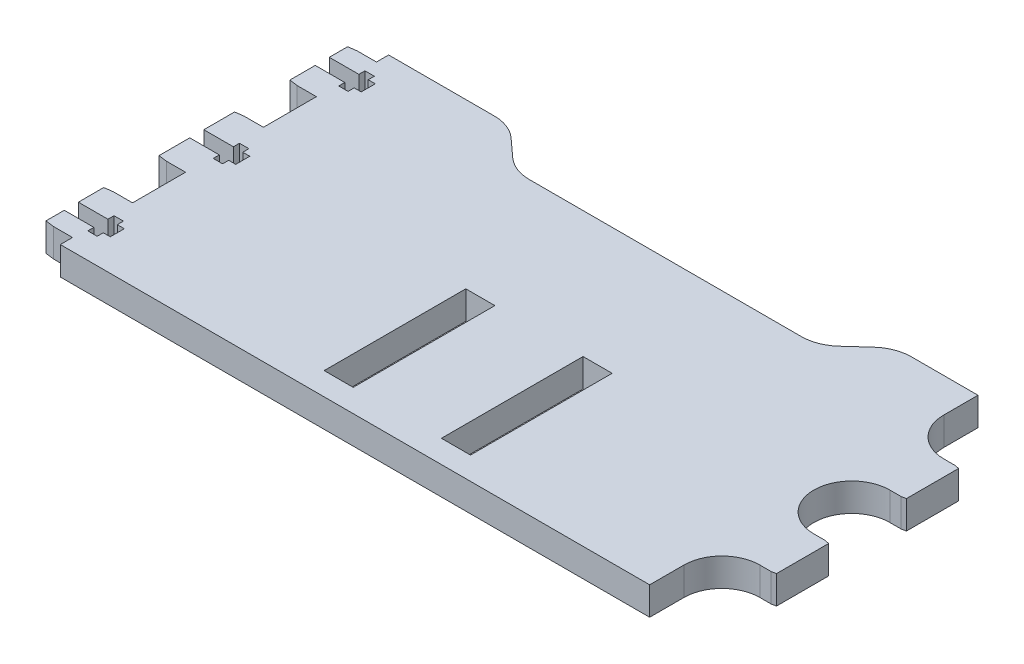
ISO-10303-21;
HEADER;
FILE_DESCRIPTION(('STEP AP214'),'2;1');
FILE_NAME('part.step','',(''),(''),'','','');
FILE_SCHEMA(('AUTOMOTIVE_DESIGN { 1 0 10303 214 1 1 1 1 }'));
ENDSEC;
DATA;
#1=APPLICATION_CONTEXT('core data for automotive mechanical design processes');
#2=APPLICATION_PROTOCOL_DEFINITION('international standard','automotive_design',2000,#1);
#3=PRODUCT_CONTEXT('',#1,'mechanical');
#4=PRODUCT('Part','Part','',(#3));
#5=PRODUCT_RELATED_PRODUCT_CATEGORY('part','',(#4));
#6=PRODUCT_DEFINITION_FORMATION('','',#4);
#7=PRODUCT_DEFINITION_CONTEXT('part definition',#1,'design');
#8=PRODUCT_DEFINITION('design','',#6,#7);
#9=PRODUCT_DEFINITION_SHAPE('','',#8);
#10=(LENGTH_UNIT() NAMED_UNIT(*) SI_UNIT(.MILLI.,.METRE.));
#11=(NAMED_UNIT(*) PLANE_ANGLE_UNIT() SI_UNIT($,.RADIAN.));
#12=(NAMED_UNIT(*) SI_UNIT($,.STERADIAN.) SOLID_ANGLE_UNIT());
#13=UNCERTAINTY_MEASURE_WITH_UNIT(LENGTH_MEASURE(1.E-05),#10,'distance_accuracy_value','');
#14=(GEOMETRIC_REPRESENTATION_CONTEXT(3) GLOBAL_UNCERTAINTY_ASSIGNED_CONTEXT((#13)) GLOBAL_UNIT_ASSIGNED_CONTEXT((#10,
#11,#12)) REPRESENTATION_CONTEXT('',''));
#15=CARTESIAN_POINT('',(0.,0.,0.));
#16=DIRECTION('',(0.,0.,1.));
#17=DIRECTION('',(1.,0.,0.));
#18=AXIS2_PLACEMENT_3D('',#15,#16,#17);
#19=CARTESIAN_POINT('',(-66.6,3.,23.95));
#20=DIRECTION('',(-1.,0.,0.));
#21=DIRECTION('',(0.,0.,1.));
#22=AXIS2_PLACEMENT_3D('',#19,#20,#21);
#23=PLANE('',#22);
#24=DIRECTION('',(0.,0.,1.));
#25=VECTOR('',#24,1.);
#26=CARTESIAN_POINT('',(-66.6,3.,0.));
#27=LINE('',#26,#25);
#28=CARTESIAN_POINT('',(-66.6,3.,25.25));
#29=VERTEX_POINT('',#28);
#30=CARTESIAN_POINT('',(-66.6,3.,23.95));
#31=VERTEX_POINT('',#30);
#32=EDGE_CURVE('E831',#29,#31,#27,.F.);
#33=ORIENTED_EDGE('',*,*,#32,.F.);
#34=DIRECTION('',(0.,1.,0.));
#35=VECTOR('',#34,1.);
#36=CARTESIAN_POINT('',(-66.6,3.,25.25));
#37=LINE('',#36,#35);
#38=CARTESIAN_POINT('',(-66.6,-3.,25.25));
#39=VERTEX_POINT('',#38);
#40=EDGE_CURVE('E747',#29,#39,#37,.F.);
#41=ORIENTED_EDGE('',*,*,#40,.T.);
#42=DIRECTION('',(0.,0.,1.));
#43=VECTOR('',#42,1.);
#44=CARTESIAN_POINT('',(-66.6,-3.,23.95));
#45=LINE('',#44,#43);
#46=CARTESIAN_POINT('',(-66.6,-3.,23.95));
#47=VERTEX_POINT('',#46);
#48=EDGE_CURVE('E1039',#47,#39,#45,.T.);
#49=ORIENTED_EDGE('',*,*,#48,.F.);
#50=DIRECTION('',(0.,1.,0.));
#51=VECTOR('',#50,1.);
#52=CARTESIAN_POINT('',(-66.6,3.,23.95));
#53=LINE('',#52,#51);
#54=EDGE_CURVE('E744',#47,#31,#53,.T.);
#55=ORIENTED_EDGE('',*,*,#54,.T.);
#56=EDGE_LOOP('',(#33,#41,#49,#55));
#57=FACE_BOUND('',#56,.T.);
#58=ADVANCED_FACE('F17',(#57),#23,.F.);
#59=CARTESIAN_POINT('',(-64.6,3.,25.25));
#60=DIRECTION('',(1.,0.,0.));
#61=DIRECTION('',(0.,0.,-1.));
#62=AXIS2_PLACEMENT_3D('',#59,#60,#61);
#63=PLANE('',#62);
#64=DIRECTION('',(0.,0.,1.));
#65=VECTOR('',#64,1.);
#66=CARTESIAN_POINT('',(-64.6,3.,0.));
#67=LINE('',#66,#65);
#68=CARTESIAN_POINT('',(-64.6,3.,23.95));
#69=VERTEX_POINT('',#68);
#70=CARTESIAN_POINT('',(-64.6,3.,25.25));
#71=VERTEX_POINT('',#70);
#72=EDGE_CURVE('E828',#69,#71,#67,.T.);
#73=ORIENTED_EDGE('',*,*,#72,.F.);
#74=DIRECTION('',(0.,1.,0.));
#75=VECTOR('',#74,1.);
#76=CARTESIAN_POINT('',(-64.6,3.,23.95));
#77=LINE('',#76,#75);
#78=CARTESIAN_POINT('',(-64.6,-3.,23.95));
#79=VERTEX_POINT('',#78);
#80=EDGE_CURVE('E736',#69,#79,#77,.F.);
#81=ORIENTED_EDGE('',*,*,#80,.T.);
#82=DIRECTION('',(0.,0.,-1.));
#83=VECTOR('',#82,1.);
#84=CARTESIAN_POINT('',(-64.6,-3.,25.25));
#85=LINE('',#84,#83);
#86=CARTESIAN_POINT('',(-64.6,-3.,25.25));
#87=VERTEX_POINT('',#86);
#88=EDGE_CURVE('E1036',#87,#79,#85,.T.);
#89=ORIENTED_EDGE('',*,*,#88,.F.);
#90=DIRECTION('',(0.,1.,0.));
#91=VECTOR('',#90,1.);
#92=CARTESIAN_POINT('',(-64.6,3.,25.25));
#93=LINE('',#92,#91);
#94=EDGE_CURVE('E1028',#87,#71,#93,.T.);
#95=ORIENTED_EDGE('',*,*,#94,.T.);
#96=EDGE_LOOP('',(#73,#81,#89,#95));
#97=FACE_BOUND('',#96,.T.);
#98=ADVANCED_FACE('F1683',(#97),#63,.F.);
#99=CARTESIAN_POINT('',(-63.1,3.,25.25));
#100=DIRECTION('',(0.,0.,-1.));
#101=DIRECTION('',(-1.,0.,0.));
#102=AXIS2_PLACEMENT_3D('',#99,#100,#101);
#103=PLANE('',#102);
#104=DIRECTION('',(1.,0.,0.));
#105=VECTOR('',#104,1.);
#106=CARTESIAN_POINT('',(0.,3.,25.25));
#107=LINE('',#106,#105);
#108=CARTESIAN_POINT('',(-63.1,3.,25.25));
#109=VERTEX_POINT('',#108);
#110=EDGE_CURVE('E825',#71,#109,#107,.T.);
#111=ORIENTED_EDGE('',*,*,#110,.F.);
#112=ORIENTED_EDGE('',*,*,#94,.F.);
#113=DIRECTION('',(-1.,0.,0.));
#114=VECTOR('',#113,1.);
#115=CARTESIAN_POINT('',(-63.1,-3.,25.25));
#116=LINE('',#115,#114);
#117=CARTESIAN_POINT('',(-63.1,-3.,25.25));
#118=VERTEX_POINT('',#117);
#119=EDGE_CURVE('E1032',#118,#87,#116,.T.);
#120=ORIENTED_EDGE('',*,*,#119,.F.);
#121=DIRECTION('',(0.,1.,0.));
#122=VECTOR('',#121,1.);
#123=CARTESIAN_POINT('',(-63.1,3.,25.25));
#124=LINE('',#123,#122);
#125=EDGE_CURVE('E732',#118,#109,#124,.T.);
#126=ORIENTED_EDGE('',*,*,#125,.T.);
#127=EDGE_LOOP('',(#111,#112,#120,#126));
#128=FACE_BOUND('',#127,.T.);
#129=ADVANCED_FACE('F1680',(#128),#103,.F.);
#130=CARTESIAN_POINT('',(-64.6,3.,28.25));
#131=DIRECTION('',(0.,0.,1.));
#132=DIRECTION('',(1.,0.,0.));
#133=AXIS2_PLACEMENT_3D('',#130,#131,#132);
#134=PLANE('',#133);
#135=DIRECTION('',(1.,0.,0.));
#136=VECTOR('',#135,1.);
#137=CARTESIAN_POINT('',(0.,3.,28.25));
#138=LINE('',#137,#136);
#139=CARTESIAN_POINT('',(-63.1,3.,28.25));
#140=VERTEX_POINT('',#139);
#141=CARTESIAN_POINT('',(-64.6,3.,28.25));
#142=VERTEX_POINT('',#141);
#143=EDGE_CURVE('E822',#140,#142,#138,.F.);
#144=ORIENTED_EDGE('',*,*,#143,.F.);
#145=DIRECTION('',(0.,1.,0.));
#146=VECTOR('',#145,1.);
#147=CARTESIAN_POINT('',(-63.1,3.,28.25));
#148=LINE('',#147,#146);
#149=CARTESIAN_POINT('',(-63.1,-3.,28.25));
#150=VERTEX_POINT('',#149);
#151=EDGE_CURVE('E724',#140,#150,#148,.F.);
#152=ORIENTED_EDGE('',*,*,#151,.T.);
#153=DIRECTION('',(1.,0.,0.));
#154=VECTOR('',#153,1.);
#155=CARTESIAN_POINT('',(-64.6,-3.,28.25));
#156=LINE('',#155,#154);
#157=CARTESIAN_POINT('',(-64.6,-3.,28.25));
#158=VERTEX_POINT('',#157);
#159=EDGE_CURVE('E1025',#158,#150,#156,.T.);
#160=ORIENTED_EDGE('',*,*,#159,.F.);
#161=DIRECTION('',(0.,1.,0.));
#162=VECTOR('',#161,1.);
#163=CARTESIAN_POINT('',(-64.6,3.,28.25));
#164=LINE('',#163,#162);
#165=EDGE_CURVE('E1017',#158,#142,#164,.T.);
#166=ORIENTED_EDGE('',*,*,#165,.T.);
#167=EDGE_LOOP('',(#144,#152,#160,#166));
#168=FACE_BOUND('',#167,.T.);
#169=ADVANCED_FACE('F1676',(#168),#134,.F.);
#170=CARTESIAN_POINT('',(-64.6,3.,29.55));
#171=DIRECTION('',(1.,0.,0.));
#172=DIRECTION('',(0.,0.,-1.));
#173=AXIS2_PLACEMENT_3D('',#170,#171,#172);
#174=PLANE('',#173);
#175=DIRECTION('',(0.,0.,1.));
#176=VECTOR('',#175,1.);
#177=CARTESIAN_POINT('',(-64.6,3.,0.));
#178=LINE('',#177,#176);
#179=CARTESIAN_POINT('',(-64.6,3.,29.55));
#180=VERTEX_POINT('',#179);
#181=EDGE_CURVE('E819',#142,#180,#178,.T.);
#182=ORIENTED_EDGE('',*,*,#181,.F.);
#183=ORIENTED_EDGE('',*,*,#165,.F.);
#184=DIRECTION('',(0.,0.,-1.));
#185=VECTOR('',#184,1.);
#186=CARTESIAN_POINT('',(-64.6,-3.,29.55));
#187=LINE('',#186,#185);
#188=CARTESIAN_POINT('',(-64.6,-3.,29.55));
#189=VERTEX_POINT('',#188);
#190=EDGE_CURVE('E1022',#189,#158,#187,.T.);
#191=ORIENTED_EDGE('',*,*,#190,.F.);
#192=DIRECTION('',(0.,1.,0.));
#193=VECTOR('',#192,1.);
#194=CARTESIAN_POINT('',(-64.6,3.,29.55));
#195=LINE('',#194,#193);
#196=EDGE_CURVE('E720',#189,#180,#195,.T.);
#197=ORIENTED_EDGE('',*,*,#196,.T.);
#198=EDGE_LOOP('',(#182,#183,#191,#197));
#199=FACE_BOUND('',#198,.T.);
#200=ADVANCED_FACE('F1672',(#199),#174,.F.);
#201=CARTESIAN_POINT('',(-66.6,3.,28.25));
#202=DIRECTION('',(-1.,0.,0.));
#203=DIRECTION('',(0.,0.,1.));
#204=AXIS2_PLACEMENT_3D('',#201,#202,#203);
#205=PLANE('',#204);
#206=DIRECTION('',(0.,0.,1.));
#207=VECTOR('',#206,1.);
#208=CARTESIAN_POINT('',(-66.6,3.,0.));
#209=LINE('',#208,#207);
#210=CARTESIAN_POINT('',(-66.6,3.,29.55));
#211=VERTEX_POINT('',#210);
#212=CARTESIAN_POINT('',(-66.6,3.,28.25));
#213=VERTEX_POINT('',#212);
#214=EDGE_CURVE('E821',#211,#213,#209,.F.);
#215=ORIENTED_EDGE('',*,*,#214,.F.);
#216=DIRECTION('',(0.,1.,0.));
#217=VECTOR('',#216,1.);
#218=CARTESIAN_POINT('',(-66.6,3.,29.55));
#219=LINE('',#218,#217);
#220=CARTESIAN_POINT('',(-66.6,-3.,29.55));
#221=VERTEX_POINT('',#220);
#222=EDGE_CURVE('E717',#211,#221,#219,.F.);
#223=ORIENTED_EDGE('',*,*,#222,.T.);
#224=DIRECTION('',(0.,0.,1.));
#225=VECTOR('',#224,1.);
#226=CARTESIAN_POINT('',(-66.6,-3.,28.25));
#227=LINE('',#226,#225);
#228=CARTESIAN_POINT('',(-66.6,-3.,28.25));
#229=VERTEX_POINT('',#228);
#230=EDGE_CURVE('E988',#229,#221,#227,.T.);
#231=ORIENTED_EDGE('',*,*,#230,.F.);
#232=DIRECTION('',(0.,1.,0.));
#233=VECTOR('',#232,1.);
#234=CARTESIAN_POINT('',(-66.6,3.,28.25));
#235=LINE('',#234,#233);
#236=EDGE_CURVE('E713',#229,#213,#235,.T.);
#237=ORIENTED_EDGE('',*,*,#236,.T.);
#238=EDGE_LOOP('',(#215,#223,#231,#237));
#239=FACE_BOUND('',#238,.T.);
#240=ADVANCED_FACE('F1669',(#239),#205,.F.);
#241=CARTESIAN_POINT('',(69.15,-3.,19.6));
#242=DIRECTION('',(0.196116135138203,0.,0.980580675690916));
#243=DIRECTION('',(0.980580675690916,0.,-0.196116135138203));
#244=AXIS2_PLACEMENT_3D('',#241,#242,#243);
#245=PLANE('',#244);
#246=DIRECTION('',(0.,1.,0.));
#247=VECTOR('',#246,1.);
#248=CARTESIAN_POINT('',(69.15,-3.,19.6));
#249=LINE('',#248,#247);
#250=CARTESIAN_POINT('',(69.15,-3.,19.6));
#251=VERTEX_POINT('',#250);
#252=CARTESIAN_POINT('',(69.15,3.,19.6));
#253=VERTEX_POINT('',#252);
#254=EDGE_CURVE('E641',#251,#253,#249,.T.);
#255=ORIENTED_EDGE('',*,*,#254,.F.);
#256=DIRECTION('',(0.980580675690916,0.,-0.196116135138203));
#257=VECTOR('',#256,1.);
#258=CARTESIAN_POINT('',(69.15,-3.,19.6));
#259=LINE('',#258,#257);
#260=CARTESIAN_POINT('',(70.1,-3.,19.41));
#261=VERTEX_POINT('',#260);
#262=EDGE_CURVE('E968',#251,#261,#259,.T.);
#263=ORIENTED_EDGE('',*,*,#262,.T.);
#264=DIRECTION('',(0.,1.,0.));
#265=VECTOR('',#264,1.);
#266=CARTESIAN_POINT('',(70.1,-3.,19.41));
#267=LINE('',#266,#265);
#268=CARTESIAN_POINT('',(70.1,3.,19.41));
#269=VERTEX_POINT('',#268);
#270=EDGE_CURVE('E963',#269,#261,#267,.F.);
#271=ORIENTED_EDGE('',*,*,#270,.F.);
#272=DIRECTION('',(0.980580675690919,0.,-0.196116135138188));
#273=VECTOR('',#272,1.);
#274=CARTESIAN_POINT('',(69.15,3.,19.6));
#275=LINE('',#274,#273);
#276=EDGE_CURVE('E973',#253,#269,#275,.T.);
#277=ORIENTED_EDGE('',*,*,#276,.F.);
#278=EDGE_LOOP('',(#255,#263,#271,#277));
#279=FACE_BOUND('',#278,.T.);
#280=ADVANCED_FACE('F1182',(#279),#245,.T.);
#281=CARTESIAN_POINT('',(70.1,-3.,8.29));
#282=DIRECTION('',(0.196116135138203,0.,-0.980580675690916));
#283=DIRECTION('',(-0.980580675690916,0.,-0.196116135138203));
#284=AXIS2_PLACEMENT_3D('',#281,#282,#283);
#285=PLANE('',#284);
#286=DIRECTION('',(0.,1.,0.));
#287=VECTOR('',#286,1.);
#288=CARTESIAN_POINT('',(70.1,-3.,8.29));
#289=LINE('',#288,#287);
#290=CARTESIAN_POINT('',(70.1,-3.,8.29));
#291=VERTEX_POINT('',#290);
#292=CARTESIAN_POINT('',(70.1,3.,8.29));
#293=VERTEX_POINT('',#292);
#294=EDGE_CURVE('E1057',#291,#293,#289,.T.);
#295=ORIENTED_EDGE('',*,*,#294,.F.);
#296=DIRECTION('',(-0.980580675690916,0.,-0.196116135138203));
#297=VECTOR('',#296,1.);
#298=CARTESIAN_POINT('',(70.1,-3.,8.29));
#299=LINE('',#298,#297);
#300=CARTESIAN_POINT('',(69.15,-3.,8.09999999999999));
#301=VERTEX_POINT('',#300);
#302=EDGE_CURVE('E955',#291,#301,#299,.T.);
#303=ORIENTED_EDGE('',*,*,#302,.T.);
#304=DIRECTION('',(0.,1.,0.));
#305=VECTOR('',#304,1.);
#306=CARTESIAN_POINT('',(69.15,-3.,8.1));
#307=LINE('',#306,#305);
#308=CARTESIAN_POINT('',(69.15,3.,8.1));
#309=VERTEX_POINT('',#308);
#310=EDGE_CURVE('E962',#309,#301,#307,.F.);
#311=ORIENTED_EDGE('',*,*,#310,.F.);
#312=DIRECTION('',(-0.98058067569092,0.,-0.196116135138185));
#313=VECTOR('',#312,1.);
#314=CARTESIAN_POINT('',(70.1,3.,8.29));
#315=LINE('',#314,#313);
#316=EDGE_CURVE('E950',#293,#309,#315,.T.);
#317=ORIENTED_EDGE('',*,*,#316,.F.);
#318=EDGE_LOOP('',(#295,#303,#311,#317));
#319=FACE_BOUND('',#318,.T.);
#320=ADVANCED_FACE('F1191',(#319),#285,.T.);
#321=CARTESIAN_POINT('',(69.15,-3.,-8.1));
#322=DIRECTION('',(0.196116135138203,0.,0.980580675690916));
#323=DIRECTION('',(0.980580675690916,0.,-0.196116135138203));
#324=AXIS2_PLACEMENT_3D('',#321,#322,#323);
#325=PLANE('',#324);
#326=DIRECTION('',(0.,1.,0.));
#327=VECTOR('',#326,1.);
#328=CARTESIAN_POINT('',(69.15,-3.,-8.1));
#329=LINE('',#328,#327);
#330=CARTESIAN_POINT('',(69.15,-3.,-8.1));
#331=VERTEX_POINT('',#330);
#332=CARTESIAN_POINT('',(69.15,3.,-8.1));
#333=VERTEX_POINT('',#332);
#334=EDGE_CURVE('E945',#331,#333,#329,.T.);
#335=ORIENTED_EDGE('',*,*,#334,.F.);
#336=DIRECTION('',(0.980580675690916,0.,-0.196116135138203));
#337=VECTOR('',#336,1.);
#338=CARTESIAN_POINT('',(69.15,-3.,-8.1));
#339=LINE('',#338,#337);
#340=CARTESIAN_POINT('',(70.1,-3.,-8.29000000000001));
#341=VERTEX_POINT('',#340);
#342=EDGE_CURVE('E933',#331,#341,#339,.T.);
#343=ORIENTED_EDGE('',*,*,#342,.T.);
#344=DIRECTION('',(0.,1.,0.));
#345=VECTOR('',#344,1.);
#346=CARTESIAN_POINT('',(70.1,-3.,-8.29));
#347=LINE('',#346,#345);
#348=CARTESIAN_POINT('',(70.1,3.,-8.29));
#349=VERTEX_POINT('',#348);
#350=EDGE_CURVE('E928',#349,#341,#347,.F.);
#351=ORIENTED_EDGE('',*,*,#350,.F.);
#352=DIRECTION('',(0.98058067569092,0.,-0.196116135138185));
#353=VECTOR('',#352,1.);
#354=CARTESIAN_POINT('',(69.15,3.,-8.1));
#355=LINE('',#354,#353);
#356=EDGE_CURVE('E938',#333,#349,#355,.T.);
#357=ORIENTED_EDGE('',*,*,#356,.F.);
#358=EDGE_LOOP('',(#335,#343,#351,#357));
#359=FACE_BOUND('',#358,.T.);
#360=ADVANCED_FACE('F1654',(#359),#325,.T.);
#361=CARTESIAN_POINT('',(70.1,-3.,-19.41));
#362=DIRECTION('',(0.196116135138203,0.,-0.980580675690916));
#363=DIRECTION('',(-0.980580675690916,0.,-0.196116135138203));
#364=AXIS2_PLACEMENT_3D('',#361,#362,#363);
#365=PLANE('',#364);
#366=DIRECTION('',(0.,1.,0.));
#367=VECTOR('',#366,1.);
#368=CARTESIAN_POINT('',(70.1,-3.,-19.41));
#369=LINE('',#368,#367);
#370=CARTESIAN_POINT('',(70.1,-3.,-19.41));
#371=VERTEX_POINT('',#370);
#372=CARTESIAN_POINT('',(70.1,3.,-19.41));
#373=VERTEX_POINT('',#372);
#374=EDGE_CURVE('E1041',#371,#373,#369,.T.);
#375=ORIENTED_EDGE('',*,*,#374,.F.);
#376=DIRECTION('',(-0.980580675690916,0.,-0.196116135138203));
#377=VECTOR('',#376,1.);
#378=CARTESIAN_POINT('',(70.1,-3.,-19.41));
#379=LINE('',#378,#377);
#380=CARTESIAN_POINT('',(69.15,-3.,-19.6));
#381=VERTEX_POINT('',#380);
#382=EDGE_CURVE('E875',#371,#381,#379,.T.);
#383=ORIENTED_EDGE('',*,*,#382,.T.);
#384=DIRECTION('',(0.,1.,0.));
#385=VECTOR('',#384,1.);
#386=CARTESIAN_POINT('',(69.15,-3.,-19.6));
#387=LINE('',#386,#385);
#388=CARTESIAN_POINT('',(69.15,3.,-19.6));
#389=VERTEX_POINT('',#388);
#390=EDGE_CURVE('E927',#389,#381,#387,.F.);
#391=ORIENTED_EDGE('',*,*,#390,.F.);
#392=DIRECTION('',(-0.980580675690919,0.,-0.196116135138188));
#393=VECTOR('',#392,1.);
#394=CARTESIAN_POINT('',(70.1,3.,-19.41));
#395=LINE('',#394,#393);
#396=EDGE_CURVE('E818',#373,#389,#395,.T.);
#397=ORIENTED_EDGE('',*,*,#396,.F.);
#398=EDGE_LOOP('',(#375,#383,#391,#397));
#399=FACE_BOUND('',#398,.T.);
#400=ADVANCED_FACE('F1653',(#399),#365,.T.);
#401=CARTESIAN_POINT('',(-66.6,3.,-29.55));
#402=DIRECTION('',(-1.,0.,0.));
#403=DIRECTION('',(0.,0.,1.));
#404=AXIS2_PLACEMENT_3D('',#401,#402,#403);
#405=PLANE('',#404);
#406=DIRECTION('',(0.,0.,1.));
#407=VECTOR('',#406,1.);
#408=CARTESIAN_POINT('',(-66.6,3.,0.));
#409=LINE('',#408,#407);
#410=CARTESIAN_POINT('',(-66.6,3.,-28.25));
#411=VERTEX_POINT('',#410);
#412=CARTESIAN_POINT('',(-66.6,3.,-29.55));
#413=VERTEX_POINT('',#412);
#414=EDGE_CURVE('E816',#411,#413,#409,.F.);
#415=ORIENTED_EDGE('',*,*,#414,.F.);
#416=DIRECTION('',(0.,1.,0.));
#417=VECTOR('',#416,1.);
#418=CARTESIAN_POINT('',(-66.6,3.,-28.25));
#419=LINE('',#418,#417);
#420=CARTESIAN_POINT('',(-66.6,-3.,-28.25));
#421=VERTEX_POINT('',#420);
#422=EDGE_CURVE('E1398',#411,#421,#419,.F.);
#423=ORIENTED_EDGE('',*,*,#422,.T.);
#424=DIRECTION('',(0.,0.,1.));
#425=VECTOR('',#424,1.);
#426=CARTESIAN_POINT('',(-66.6,-3.,-29.55));
#427=LINE('',#426,#425);
#428=CARTESIAN_POINT('',(-66.6,-3.,-29.55));
#429=VERTEX_POINT('',#428);
#430=EDGE_CURVE('E873',#429,#421,#427,.T.);
#431=ORIENTED_EDGE('',*,*,#430,.F.);
#432=DIRECTION('',(0.,1.,0.));
#433=VECTOR('',#432,1.);
#434=CARTESIAN_POINT('',(-66.6,3.,-29.55));
#435=LINE('',#434,#433);
#436=EDGE_CURVE('E1395',#429,#413,#435,.T.);
#437=ORIENTED_EDGE('',*,*,#436,.T.);
#438=EDGE_LOOP('',(#415,#423,#431,#437));
#439=FACE_BOUND('',#438,.T.);
#440=ADVANCED_FACE('F1662',(#439),#405,.F.);
#441=CARTESIAN_POINT('',(-64.6,3.,-28.25));
#442=DIRECTION('',(1.,0.,0.));
#443=DIRECTION('',(0.,0.,-1.));
#444=AXIS2_PLACEMENT_3D('',#441,#442,#443);
#445=PLANE('',#444);
#446=DIRECTION('',(0.,0.,1.));
#447=VECTOR('',#446,1.);
#448=CARTESIAN_POINT('',(-64.6,3.,0.));
#449=LINE('',#448,#447);
#450=CARTESIAN_POINT('',(-64.6,3.,-29.55));
#451=VERTEX_POINT('',#450);
#452=CARTESIAN_POINT('',(-64.6,3.,-28.25));
#453=VERTEX_POINT('',#452);
#454=EDGE_CURVE('E814',#451,#453,#449,.T.);
#455=ORIENTED_EDGE('',*,*,#454,.F.);
#456=DIRECTION('',(0.,1.,0.));
#457=VECTOR('',#456,1.);
#458=CARTESIAN_POINT('',(-64.6,3.,-29.55));
#459=LINE('',#458,#457);
#460=CARTESIAN_POINT('',(-64.6,-3.,-29.55));
#461=VERTEX_POINT('',#460);
#462=EDGE_CURVE('E1389',#451,#461,#459,.F.);
#463=ORIENTED_EDGE('',*,*,#462,.T.);
#464=DIRECTION('',(0.,0.,-1.));
#465=VECTOR('',#464,1.);
#466=CARTESIAN_POINT('',(-64.6,-3.,-28.25));
#467=LINE('',#466,#465);
#468=CARTESIAN_POINT('',(-64.6,-3.,-28.25));
#469=VERTEX_POINT('',#468);
#470=EDGE_CURVE('E871',#469,#461,#467,.T.);
#471=ORIENTED_EDGE('',*,*,#470,.F.);
#472=DIRECTION('',(0.,1.,0.));
#473=VECTOR('',#472,1.);
#474=CARTESIAN_POINT('',(-64.6,3.,-28.25));
#475=LINE('',#474,#473);
#476=EDGE_CURVE('E865',#469,#453,#475,.T.);
#477=ORIENTED_EDGE('',*,*,#476,.T.);
#478=EDGE_LOOP('',(#455,#463,#471,#477));
#479=FACE_BOUND('',#478,.T.);
#480=ADVANCED_FACE('F1884',(#479),#445,.F.);
#481=CARTESIAN_POINT('',(-63.1,3.,-28.25));
#482=DIRECTION('',(0.,0.,-1.));
#483=DIRECTION('',(-1.,0.,0.));
#484=AXIS2_PLACEMENT_3D('',#481,#482,#483);
#485=PLANE('',#484);
#486=DIRECTION('',(1.,0.,0.));
#487=VECTOR('',#486,1.);
#488=CARTESIAN_POINT('',(0.,3.,-28.25));
#489=LINE('',#488,#487);
#490=CARTESIAN_POINT('',(-63.1,3.,-28.25));
#491=VERTEX_POINT('',#490);
#492=EDGE_CURVE('E812',#453,#491,#489,.T.);
#493=ORIENTED_EDGE('',*,*,#492,.F.);
#494=ORIENTED_EDGE('',*,*,#476,.F.);
#495=DIRECTION('',(-1.,0.,0.));
#496=VECTOR('',#495,1.);
#497=CARTESIAN_POINT('',(-63.1,-3.,-28.25));
#498=LINE('',#497,#496);
#499=CARTESIAN_POINT('',(-63.1,-3.,-28.25));
#500=VERTEX_POINT('',#499);
#501=EDGE_CURVE('E868',#500,#469,#498,.T.);
#502=ORIENTED_EDGE('',*,*,#501,.F.);
#503=DIRECTION('',(0.,1.,0.));
#504=VECTOR('',#503,1.);
#505=CARTESIAN_POINT('',(-63.1,3.,-28.25));
#506=LINE('',#505,#504);
#507=EDGE_CURVE('E1386',#500,#491,#506,.T.);
#508=ORIENTED_EDGE('',*,*,#507,.T.);
#509=EDGE_LOOP('',(#493,#494,#502,#508));
#510=FACE_BOUND('',#509,.T.);
#511=ADVANCED_FACE('F1888',(#510),#485,.F.);
#512=CARTESIAN_POINT('',(-64.6,3.,-25.25));
#513=DIRECTION('',(0.,0.,1.));
#514=DIRECTION('',(1.,0.,0.));
#515=AXIS2_PLACEMENT_3D('',#512,#513,#514);
#516=PLANE('',#515);
#517=DIRECTION('',(1.,0.,0.));
#518=VECTOR('',#517,1.);
#519=CARTESIAN_POINT('',(0.,3.,-25.25));
#520=LINE('',#519,#518);
#521=CARTESIAN_POINT('',(-63.1,3.,-25.25));
#522=VERTEX_POINT('',#521);
#523=CARTESIAN_POINT('',(-64.6,3.,-25.25));
#524=VERTEX_POINT('',#523);
#525=EDGE_CURVE('E810',#522,#524,#520,.F.);
#526=ORIENTED_EDGE('',*,*,#525,.F.);
#527=DIRECTION('',(0.,1.,0.));
#528=VECTOR('',#527,1.);
#529=CARTESIAN_POINT('',(-63.1,3.,-25.25));
#530=LINE('',#529,#528);
#531=CARTESIAN_POINT('',(-63.1,-3.,-25.25));
#532=VERTEX_POINT('',#531);
#533=EDGE_CURVE('E1380',#522,#532,#530,.F.);
#534=ORIENTED_EDGE('',*,*,#533,.T.);
#535=DIRECTION('',(1.,0.,0.));
#536=VECTOR('',#535,1.);
#537=CARTESIAN_POINT('',(-64.6,-3.,-25.25));
#538=LINE('',#537,#536);
#539=CARTESIAN_POINT('',(-64.6,-3.,-25.25));
#540=VERTEX_POINT('',#539);
#541=EDGE_CURVE('E863',#540,#532,#538,.T.);
#542=ORIENTED_EDGE('',*,*,#541,.F.);
#543=DIRECTION('',(0.,1.,0.));
#544=VECTOR('',#543,1.);
#545=CARTESIAN_POINT('',(-64.6,3.,-25.25));
#546=LINE('',#545,#544);
#547=EDGE_CURVE('E857',#540,#524,#546,.T.);
#548=ORIENTED_EDGE('',*,*,#547,.T.);
#549=EDGE_LOOP('',(#526,#534,#542,#548));
#550=FACE_BOUND('',#549,.T.);
#551=ADVANCED_FACE('F1894',(#550),#516,.F.);
#552=CARTESIAN_POINT('',(-64.6,3.,-23.95));
#553=DIRECTION('',(1.,0.,0.));
#554=DIRECTION('',(0.,0.,-1.));
#555=AXIS2_PLACEMENT_3D('',#552,#553,#554);
#556=PLANE('',#555);
#557=DIRECTION('',(0.,0.,1.));
#558=VECTOR('',#557,1.);
#559=CARTESIAN_POINT('',(-64.6,3.,0.));
#560=LINE('',#559,#558);
#561=CARTESIAN_POINT('',(-64.6,3.,-23.95));
#562=VERTEX_POINT('',#561);
#563=EDGE_CURVE('E808',#524,#562,#560,.T.);
#564=ORIENTED_EDGE('',*,*,#563,.F.);
#565=ORIENTED_EDGE('',*,*,#547,.F.);
#566=DIRECTION('',(0.,0.,-1.));
#567=VECTOR('',#566,1.);
#568=CARTESIAN_POINT('',(-64.6,-3.,-23.95));
#569=LINE('',#568,#567);
#570=CARTESIAN_POINT('',(-64.6,-3.,-23.95));
#571=VERTEX_POINT('',#570);
#572=EDGE_CURVE('E860',#571,#540,#569,.T.);
#573=ORIENTED_EDGE('',*,*,#572,.F.);
#574=DIRECTION('',(0.,1.,0.));
#575=VECTOR('',#574,1.);
#576=CARTESIAN_POINT('',(-64.6,3.,-23.95));
#577=LINE('',#576,#575);
#578=EDGE_CURVE('E1377',#571,#562,#577,.T.);
#579=ORIENTED_EDGE('',*,*,#578,.T.);
#580=EDGE_LOOP('',(#564,#565,#573,#579));
#581=FACE_BOUND('',#580,.T.);
#582=ADVANCED_FACE('F1898',(#581),#556,.F.);
#583=CARTESIAN_POINT('',(-66.6,3.,-25.25));
#584=DIRECTION('',(-1.,0.,0.));
#585=DIRECTION('',(0.,0.,1.));
#586=AXIS2_PLACEMENT_3D('',#583,#584,#585);
#587=PLANE('',#586);
#588=DIRECTION('',(0.,0.,1.));
#589=VECTOR('',#588,1.);
#590=CARTESIAN_POINT('',(-66.6,3.,0.));
#591=LINE('',#590,#589);
#592=CARTESIAN_POINT('',(-66.6,3.,-23.95));
#593=VERTEX_POINT('',#592);
#594=CARTESIAN_POINT('',(-66.6,3.,-25.25));
#595=VERTEX_POINT('',#594);
#596=EDGE_CURVE('E806',#593,#595,#591,.F.);
#597=ORIENTED_EDGE('',*,*,#596,.F.);
#598=DIRECTION('',(0.,1.,0.));
#599=VECTOR('',#598,1.);
#600=CARTESIAN_POINT('',(-66.6,3.,-23.95));
#601=LINE('',#600,#599);
#602=CARTESIAN_POINT('',(-66.6,-3.,-23.95));
#603=VERTEX_POINT('',#602);
#604=EDGE_CURVE('E1371',#593,#603,#601,.F.);
#605=ORIENTED_EDGE('',*,*,#604,.T.);
#606=DIRECTION('',(0.,0.,1.));
#607=VECTOR('',#606,1.);
#608=CARTESIAN_POINT('',(-66.6,-3.,-25.25));
#609=LINE('',#608,#607);
#610=CARTESIAN_POINT('',(-66.6,-3.,-25.25));
#611=VERTEX_POINT('',#610);
#612=EDGE_CURVE('E855',#611,#603,#609,.T.);
#613=ORIENTED_EDGE('',*,*,#612,.F.);
#614=DIRECTION('',(0.,1.,0.));
#615=VECTOR('',#614,1.);
#616=CARTESIAN_POINT('',(-66.6,3.,-25.25));
#617=LINE('',#616,#615);
#618=EDGE_CURVE('E1368',#611,#595,#617,.T.);
#619=ORIENTED_EDGE('',*,*,#618,.T.);
#620=EDGE_LOOP('',(#597,#605,#613,#619));
#621=FACE_BOUND('',#620,.T.);
#622=ADVANCED_FACE('F1902',(#621),#587,.F.);
#623=CARTESIAN_POINT('',(-66.6,3.,-2.8));
#624=DIRECTION('',(-1.,0.,0.));
#625=DIRECTION('',(0.,0.,1.));
#626=AXIS2_PLACEMENT_3D('',#623,#624,#625);
#627=PLANE('',#626);
#628=DIRECTION('',(0.,0.,1.));
#629=VECTOR('',#628,1.);
#630=CARTESIAN_POINT('',(-66.6,3.,0.));
#631=LINE('',#630,#629);
#632=CARTESIAN_POINT('',(-66.6,3.,-1.5));
#633=VERTEX_POINT('',#632);
#634=CARTESIAN_POINT('',(-66.6,3.,-2.8));
#635=VERTEX_POINT('',#634);
#636=EDGE_CURVE('E804',#633,#635,#631,.F.);
#637=ORIENTED_EDGE('',*,*,#636,.F.);
#638=DIRECTION('',(0.,1.,0.));
#639=VECTOR('',#638,1.);
#640=CARTESIAN_POINT('',(-66.6,3.,-1.5));
#641=LINE('',#640,#639);
#642=CARTESIAN_POINT('',(-66.6,-3.,-1.5));
#643=VERTEX_POINT('',#642);
#644=EDGE_CURVE('E1328',#633,#643,#641,.F.);
#645=ORIENTED_EDGE('',*,*,#644,.T.);
#646=DIRECTION('',(0.,0.,1.));
#647=VECTOR('',#646,1.);
#648=CARTESIAN_POINT('',(-66.6,-3.,-2.8));
#649=LINE('',#648,#647);
#650=CARTESIAN_POINT('',(-66.6,-3.,-2.8));
#651=VERTEX_POINT('',#650);
#652=EDGE_CURVE('E853',#651,#643,#649,.T.);
#653=ORIENTED_EDGE('',*,*,#652,.F.);
#654=DIRECTION('',(0.,1.,0.));
#655=VECTOR('',#654,1.);
#656=CARTESIAN_POINT('',(-66.6,3.,-2.8));
#657=LINE('',#656,#655);
#658=EDGE_CURVE('E1325',#651,#635,#657,.T.);
#659=ORIENTED_EDGE('',*,*,#658,.T.);
#660=EDGE_LOOP('',(#637,#645,#653,#659));
#661=FACE_BOUND('',#660,.T.);
#662=ADVANCED_FACE('F1906',(#661),#627,.F.);
#663=CARTESIAN_POINT('',(-64.6,3.,-1.5));
#664=DIRECTION('',(1.,0.,0.));
#665=DIRECTION('',(0.,0.,-1.));
#666=AXIS2_PLACEMENT_3D('',#663,#664,#665);
#667=PLANE('',#666);
#668=DIRECTION('',(0.,0.,1.));
#669=VECTOR('',#668,1.);
#670=CARTESIAN_POINT('',(-64.6,3.,0.));
#671=LINE('',#670,#669);
#672=CARTESIAN_POINT('',(-64.6,3.,-2.8));
#673=VERTEX_POINT('',#672);
#674=CARTESIAN_POINT('',(-64.6,3.,-1.5));
#675=VERTEX_POINT('',#674);
#676=EDGE_CURVE('E801',#673,#675,#671,.T.);
#677=ORIENTED_EDGE('',*,*,#676,.F.);
#678=DIRECTION('',(0.,1.,0.));
#679=VECTOR('',#678,1.);
#680=CARTESIAN_POINT('',(-64.6,3.,-2.8));
#681=LINE('',#680,#679);
#682=CARTESIAN_POINT('',(-64.6,-3.,-2.8));
#683=VERTEX_POINT('',#682);
#684=EDGE_CURVE('E1317',#673,#683,#681,.F.);
#685=ORIENTED_EDGE('',*,*,#684,.T.);
#686=DIRECTION('',(0.,0.,-1.));
#687=VECTOR('',#686,1.);
#688=CARTESIAN_POINT('',(-64.6,-3.,-1.5));
#689=LINE('',#688,#687);
#690=CARTESIAN_POINT('',(-64.6,-3.,-1.5));
#691=VERTEX_POINT('',#690);
#692=EDGE_CURVE('E851',#691,#683,#689,.T.);
#693=ORIENTED_EDGE('',*,*,#692,.F.);
#694=DIRECTION('',(0.,1.,0.));
#695=VECTOR('',#694,1.);
#696=CARTESIAN_POINT('',(-64.6,3.,-1.5));
#697=LINE('',#696,#695);
#698=EDGE_CURVE('E844',#691,#675,#697,.T.);
#699=ORIENTED_EDGE('',*,*,#698,.T.);
#700=EDGE_LOOP('',(#677,#685,#693,#699));
#701=FACE_BOUND('',#700,.T.);
#702=ADVANCED_FACE('F1910',(#701),#667,.F.);
#703=CARTESIAN_POINT('',(-63.1,3.,-1.5));
#704=DIRECTION('',(0.,0.,-1.));
#705=DIRECTION('',(-1.,0.,0.));
#706=AXIS2_PLACEMENT_3D('',#703,#704,#705);
#707=PLANE('',#706);
#708=DIRECTION('',(1.,0.,0.));
#709=VECTOR('',#708,1.);
#710=CARTESIAN_POINT('',(0.,3.,-1.5));
#711=LINE('',#710,#709);
#712=CARTESIAN_POINT('',(-63.1,3.,-1.5));
#713=VERTEX_POINT('',#712);
#714=EDGE_CURVE('E798',#675,#713,#711,.T.);
#715=ORIENTED_EDGE('',*,*,#714,.F.);
#716=ORIENTED_EDGE('',*,*,#698,.F.);
#717=DIRECTION('',(-1.,0.,0.));
#718=VECTOR('',#717,1.);
#719=CARTESIAN_POINT('',(-63.1,-3.,-1.5));
#720=LINE('',#719,#718);
#721=CARTESIAN_POINT('',(-63.1,-3.,-1.5));
#722=VERTEX_POINT('',#721);
#723=EDGE_CURVE('E848',#722,#691,#720,.T.);
#724=ORIENTED_EDGE('',*,*,#723,.F.);
#725=DIRECTION('',(0.,1.,0.));
#726=VECTOR('',#725,1.);
#727=CARTESIAN_POINT('',(-63.1,3.,-1.5));
#728=LINE('',#727,#726);
#729=EDGE_CURVE('E1313',#722,#713,#728,.T.);
#730=ORIENTED_EDGE('',*,*,#729,.T.);
#731=EDGE_LOOP('',(#715,#716,#724,#730));
#732=FACE_BOUND('',#731,.T.);
#733=ADVANCED_FACE('F1914',(#732),#707,.F.);
#734=CARTESIAN_POINT('',(-64.6,3.,1.5));
#735=DIRECTION('',(0.,0.,1.));
#736=DIRECTION('',(1.,0.,0.));
#737=AXIS2_PLACEMENT_3D('',#734,#735,#736);
#738=PLANE('',#737);
#739=DIRECTION('',(1.,0.,0.));
#740=VECTOR('',#739,1.);
#741=CARTESIAN_POINT('',(0.,3.,1.5));
#742=LINE('',#741,#740);
#743=CARTESIAN_POINT('',(-63.1,3.,1.5));
#744=VERTEX_POINT('',#743);
#745=CARTESIAN_POINT('',(-64.6,3.,1.5));
#746=VERTEX_POINT('',#745);
#747=EDGE_CURVE('E795',#744,#746,#742,.F.);
#748=ORIENTED_EDGE('',*,*,#747,.F.);
#749=DIRECTION('',(0.,1.,0.));
#750=VECTOR('',#749,1.);
#751=CARTESIAN_POINT('',(-63.1,3.,1.5));
#752=LINE('',#751,#750);
#753=CARTESIAN_POINT('',(-63.1,-3.,1.5));
#754=VERTEX_POINT('',#753);
#755=EDGE_CURVE('E1305',#744,#754,#752,.F.);
#756=ORIENTED_EDGE('',*,*,#755,.T.);
#757=DIRECTION('',(1.,0.,0.));
#758=VECTOR('',#757,1.);
#759=CARTESIAN_POINT('',(-64.6,-3.,1.5));
#760=LINE('',#759,#758);
#761=CARTESIAN_POINT('',(-64.6,-3.,1.5));
#762=VERTEX_POINT('',#761);
#763=EDGE_CURVE('E842',#762,#754,#760,.T.);
#764=ORIENTED_EDGE('',*,*,#763,.F.);
#765=DIRECTION('',(0.,1.,0.));
#766=VECTOR('',#765,1.);
#767=CARTESIAN_POINT('',(-64.6,3.,1.5));
#768=LINE('',#767,#766);
#769=EDGE_CURVE('E835',#762,#746,#768,.T.);
#770=ORIENTED_EDGE('',*,*,#769,.T.);
#771=EDGE_LOOP('',(#748,#756,#764,#770));
#772=FACE_BOUND('',#771,.T.);
#773=ADVANCED_FACE('F1918',(#772),#738,.F.);
#774=CARTESIAN_POINT('',(-64.6,3.,2.8));
#775=DIRECTION('',(1.,0.,0.));
#776=DIRECTION('',(0.,0.,-1.));
#777=AXIS2_PLACEMENT_3D('',#774,#775,#776);
#778=PLANE('',#777);
#779=DIRECTION('',(0.,0.,1.));
#780=VECTOR('',#779,1.);
#781=CARTESIAN_POINT('',(-64.6,3.,0.));
#782=LINE('',#781,#780);
#783=CARTESIAN_POINT('',(-64.6,3.,2.8));
#784=VERTEX_POINT('',#783);
#785=EDGE_CURVE('E792',#746,#784,#782,.T.);
#786=ORIENTED_EDGE('',*,*,#785,.F.);
#787=ORIENTED_EDGE('',*,*,#769,.F.);
#788=DIRECTION('',(0.,0.,-1.));
#789=VECTOR('',#788,1.);
#790=CARTESIAN_POINT('',(-64.6,-3.,2.8));
#791=LINE('',#790,#789);
#792=CARTESIAN_POINT('',(-64.6,-3.,2.8));
#793=VERTEX_POINT('',#792);
#794=EDGE_CURVE('E839',#793,#762,#791,.T.);
#795=ORIENTED_EDGE('',*,*,#794,.F.);
#796=DIRECTION('',(0.,1.,0.));
#797=VECTOR('',#796,1.);
#798=CARTESIAN_POINT('',(-64.6,3.,2.8));
#799=LINE('',#798,#797);
#800=EDGE_CURVE('E1301',#793,#784,#799,.T.);
#801=ORIENTED_EDGE('',*,*,#800,.T.);
#802=EDGE_LOOP('',(#786,#787,#795,#801));
#803=FACE_BOUND('',#802,.T.);
#804=ADVANCED_FACE('F1922',(#803),#778,.F.);
#805=CARTESIAN_POINT('',(-66.6,3.,1.5));
#806=DIRECTION('',(-1.,0.,0.));
#807=DIRECTION('',(0.,0.,1.));
#808=AXIS2_PLACEMENT_3D('',#805,#806,#807);
#809=PLANE('',#808);
#810=DIRECTION('',(0.,0.,1.));
#811=VECTOR('',#810,1.);
#812=CARTESIAN_POINT('',(-66.6,3.,0.));
#813=LINE('',#812,#811);
#814=CARTESIAN_POINT('',(-66.6,3.,2.8));
#815=VERTEX_POINT('',#814);
#816=CARTESIAN_POINT('',(-66.6,3.,1.5));
#817=VERTEX_POINT('',#816);
#818=EDGE_CURVE('E790',#815,#817,#813,.F.);
#819=ORIENTED_EDGE('',*,*,#818,.F.);
#820=DIRECTION('',(0.,1.,0.));
#821=VECTOR('',#820,1.);
#822=CARTESIAN_POINT('',(-66.6,3.,2.8));
#823=LINE('',#822,#821);
#824=CARTESIAN_POINT('',(-66.6,-3.,2.8));
#825=VERTEX_POINT('',#824);
#826=EDGE_CURVE('E1294',#815,#825,#823,.F.);
#827=ORIENTED_EDGE('',*,*,#826,.T.);
#828=DIRECTION('',(0.,0.,1.));
#829=VECTOR('',#828,1.);
#830=CARTESIAN_POINT('',(-66.6,-3.,1.5));
#831=LINE('',#830,#829);
#832=CARTESIAN_POINT('',(-66.6,-3.,1.5));
#833=VERTEX_POINT('',#832);
#834=EDGE_CURVE('E833',#833,#825,#831,.T.);
#835=ORIENTED_EDGE('',*,*,#834,.F.);
#836=DIRECTION('',(0.,1.,0.));
#837=VECTOR('',#836,1.);
#838=CARTESIAN_POINT('',(-66.6,3.,1.5));
#839=LINE('',#838,#837);
#840=EDGE_CURVE('E787',#833,#817,#839,.T.);
#841=ORIENTED_EDGE('',*,*,#840,.T.);
#842=EDGE_LOOP('',(#819,#827,#835,#841));
#843=FACE_BOUND('',#842,.T.);
#844=ADVANCED_FACE('F1747',(#843),#809,.F.);
#845=CARTESIAN_POINT('',(0.,3.,0.));
#846=DIRECTION('',(0.,1.,0.));
#847=DIRECTION('',(0.,0.,1.));
#848=AXIS2_PLACEMENT_3D('',#845,#846,#847);
#849=PLANE('',#848);
#850=DIRECTION('',(1.,0.,0.));
#851=VECTOR('',#850,1.);
#852=CARTESIAN_POINT('',(9.4,3.,30.15));
#853=LINE('',#852,#851);
#854=CARTESIAN_POINT('',(15.6,3.,30.15));
#855=VERTEX_POINT('',#854);
#856=CARTESIAN_POINT('',(9.4,3.,30.15));
#857=VERTEX_POINT('',#856);
#858=EDGE_CURVE('E1251',#855,#857,#853,.F.);
#859=ORIENTED_EDGE('',*,*,#858,.T.);
#860=DIRECTION('',(0.,0.,1.));
#861=VECTOR('',#860,1.);
#862=CARTESIAN_POINT('',(9.4,3.,-0.05000000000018));
#863=LINE('',#862,#861);
#864=CARTESIAN_POINT('',(9.4,3.,-0.05000000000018));
#865=VERTEX_POINT('',#864);
#866=EDGE_CURVE('E1269',#857,#865,#863,.F.);
#867=ORIENTED_EDGE('',*,*,#866,.T.);
#868=DIRECTION('',(-1.,0.,0.));
#869=VECTOR('',#868,1.);
#870=CARTESIAN_POINT('',(15.6,3.,-0.05000000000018));
#871=LINE('',#870,#869);
#872=CARTESIAN_POINT('',(15.6,3.,-0.0500000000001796));
#873=VERTEX_POINT('',#872);
#874=EDGE_CURVE('E1262',#865,#873,#871,.F.);
#875=ORIENTED_EDGE('',*,*,#874,.T.);
#876=DIRECTION('',(0.,0.,-1.));
#877=VECTOR('',#876,1.);
#878=CARTESIAN_POINT('',(15.6,3.,30.15));
#879=LINE('',#878,#877);
#880=EDGE_CURVE('E1255',#873,#855,#879,.F.);
#881=ORIENTED_EDGE('',*,*,#880,.T.);
#882=EDGE_LOOP('',(#859,#867,#875,#881));
#883=FACE_BOUND('',#882,.T.);
#884=DIRECTION('',(1.,0.,0.));
#885=VECTOR('',#884,1.);
#886=CARTESIAN_POINT('',(-15.6,3.,30.15));
#887=LINE('',#886,#885);
#888=CARTESIAN_POINT('',(-9.4,3.,30.15));
#889=VERTEX_POINT('',#888);
#890=CARTESIAN_POINT('',(-15.6,3.,30.15));
#891=VERTEX_POINT('',#890);
#892=EDGE_CURVE('E1276',#889,#891,#887,.F.);
#893=ORIENTED_EDGE('',*,*,#892,.T.);
#894=DIRECTION('',(0.,0.,1.));
#895=VECTOR('',#894,1.);
#896=CARTESIAN_POINT('',(-15.6,3.,-0.05000000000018));
#897=LINE('',#896,#895);
#898=CARTESIAN_POINT('',(-15.6,3.,-0.05000000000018));
#899=VERTEX_POINT('',#898);
#900=EDGE_CURVE('E1292',#891,#899,#897,.F.);
#901=ORIENTED_EDGE('',*,*,#900,.T.);
#902=DIRECTION('',(-1.,0.,0.));
#903=VECTOR('',#902,1.);
#904=CARTESIAN_POINT('',(-9.4,3.,-0.05000000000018));
#905=LINE('',#904,#903);
#906=CARTESIAN_POINT('',(-9.4,3.,-0.0500000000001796));
#907=VERTEX_POINT('',#906);
#908=EDGE_CURVE('E1287',#899,#907,#905,.F.);
#909=ORIENTED_EDGE('',*,*,#908,.T.);
#910=DIRECTION('',(0.,0.,-1.));
#911=VECTOR('',#910,1.);
#912=CARTESIAN_POINT('',(-9.4,3.,30.15));
#913=LINE('',#912,#911);
#914=EDGE_CURVE('E1282',#907,#889,#913,.F.);
#915=ORIENTED_EDGE('',*,*,#914,.T.);
#916=EDGE_LOOP('',(#893,#901,#909,#915));
#917=FACE_BOUND('',#916,.T.);
#918=ORIENTED_EDGE('',*,*,#818,.T.);
#919=DIRECTION('',(1.,0.,0.));
#920=VECTOR('',#919,1.);
#921=CARTESIAN_POINT('',(-72.9,3.,1.5));
#922=LINE('',#921,#920);
#923=CARTESIAN_POINT('',(-72.9,3.,1.5));
#924=VERTEX_POINT('',#923);
#925=EDGE_CURVE('E784',#817,#924,#922,.F.);
#926=ORIENTED_EDGE('',*,*,#925,.T.);
#927=DIRECTION('',(0.,0.,1.));
#928=VECTOR('',#927,1.);
#929=CARTESIAN_POINT('',(-72.9,3.,-8.05));
#930=LINE('',#929,#928);
#931=CARTESIAN_POINT('',(-72.9,3.,8.05));
#932=VERTEX_POINT('',#931);
#933=EDGE_CURVE('E782',#932,#924,#930,.F.);
#934=ORIENTED_EDGE('',*,*,#933,.F.);
#935=DIRECTION('',(0.990492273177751,0.,0.137568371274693));
#936=VECTOR('',#935,1.);
#937=CARTESIAN_POINT('',(-72.9,3.,8.05));
#938=LINE('',#937,#936);
#939=CARTESIAN_POINT('',(-71.0999999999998,3.,8.30000000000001));
#940=VERTEX_POINT('',#939);
#941=EDGE_CURVE('E778',#940,#932,#938,.F.);
#942=ORIENTED_EDGE('',*,*,#941,.F.);
#943=DIRECTION('',(1.,0.,0.));
#944=VECTOR('',#943,1.);
#945=CARTESIAN_POINT('',(-71.1,3.,8.3));
#946=LINE('',#945,#944);
#947=CARTESIAN_POINT('',(-67.,3.,8.3));
#948=VERTEX_POINT('',#947);
#949=EDGE_CURVE('E774',#948,#940,#946,.F.);
#950=ORIENTED_EDGE('',*,*,#949,.F.);
#951=DIRECTION('',(0.,0.,1.));
#952=VECTOR('',#951,1.);
#953=CARTESIAN_POINT('',(-67.,3.,8.3));
#954=LINE('',#953,#952);
#955=CARTESIAN_POINT('',(-67.,3.,19.6));
#956=VERTEX_POINT('',#955);
#957=EDGE_CURVE('E770',#956,#948,#954,.F.);
#958=ORIENTED_EDGE('',*,*,#957,.F.);
#959=DIRECTION('',(-1.,0.,0.));
#960=VECTOR('',#959,1.);
#961=CARTESIAN_POINT('',(-67.,3.,19.6));
#962=LINE('',#961,#960);
#963=CARTESIAN_POINT('',(-71.0999999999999,3.,19.6));
#964=VERTEX_POINT('',#963);
#965=EDGE_CURVE('E766',#964,#956,#962,.F.);
#966=ORIENTED_EDGE('',*,*,#965,.F.);
#967=DIRECTION('',(-0.990492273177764,0.,0.137568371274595));
#968=VECTOR('',#967,1.);
#969=CARTESIAN_POINT('',(-71.1,3.,19.6));
#970=LINE('',#969,#968);
#971=CARTESIAN_POINT('',(-72.9,3.,19.85));
#972=VERTEX_POINT('',#971);
#973=EDGE_CURVE('E762',#972,#964,#970,.F.);
#974=ORIENTED_EDGE('',*,*,#973,.F.);
#975=DIRECTION('',(0.,0.,1.));
#976=VECTOR('',#975,1.);
#977=CARTESIAN_POINT('',(-72.9,3.,19.85));
#978=LINE('',#977,#976);
#979=CARTESIAN_POINT('',(-72.9,3.,25.25));
#980=VERTEX_POINT('',#979);
#981=EDGE_CURVE('E758',#980,#972,#978,.F.);
#982=ORIENTED_EDGE('',*,*,#981,.F.);
#983=DIRECTION('',(-1.,0.,0.));
#984=VECTOR('',#983,1.);
#985=CARTESIAN_POINT('',(-66.6,3.,25.25));
#986=LINE('',#985,#984);
#987=EDGE_CURVE('E750',#980,#29,#986,.F.);
#988=ORIENTED_EDGE('',*,*,#987,.T.);
#989=ORIENTED_EDGE('',*,*,#32,.T.);
#990=DIRECTION('',(-1.,0.,0.));
#991=VECTOR('',#990,1.);
#992=CARTESIAN_POINT('',(-64.6,3.,23.95));
#993=LINE('',#992,#991);
#994=EDGE_CURVE('E740',#31,#69,#993,.F.);
#995=ORIENTED_EDGE('',*,*,#994,.T.);
#996=ORIENTED_EDGE('',*,*,#72,.T.);
#997=ORIENTED_EDGE('',*,*,#110,.T.);
#998=DIRECTION('',(0.,0.,-1.));
#999=VECTOR('',#998,1.);
#1000=CARTESIAN_POINT('',(-63.1,3.,28.25));
#1001=LINE('',#1000,#999);
#1002=EDGE_CURVE('E728',#109,#140,#1001,.F.);
#1003=ORIENTED_EDGE('',*,*,#1002,.T.);
#1004=ORIENTED_EDGE('',*,*,#143,.T.);
#1005=ORIENTED_EDGE('',*,*,#181,.T.);
#1006=DIRECTION('',(1.,0.,0.));
#1007=VECTOR('',#1006,1.);
#1008=CARTESIAN_POINT('',(-66.6,3.,29.55));
#1009=LINE('',#1008,#1007);
#1010=EDGE_CURVE('E723',#180,#211,#1009,.F.);
#1011=ORIENTED_EDGE('',*,*,#1010,.T.);
#1012=ORIENTED_EDGE('',*,*,#214,.T.);
#1013=DIRECTION('',(1.,0.,0.));
#1014=VECTOR('',#1013,1.);
#1015=CARTESIAN_POINT('',(-72.9,3.,28.25));
#1016=LINE('',#1015,#1014);
#1017=CARTESIAN_POINT('',(-72.9,3.,28.25));
#1018=VERTEX_POINT('',#1017);
#1019=EDGE_CURVE('E716',#213,#1018,#1016,.F.);
#1020=ORIENTED_EDGE('',*,*,#1019,.T.);
#1021=DIRECTION('',(0.,0.,1.));
#1022=VECTOR('',#1021,1.);
#1023=CARTESIAN_POINT('',(-72.9,3.,19.85));
#1024=LINE('',#1023,#1022);
#1025=CARTESIAN_POINT('',(-72.9,3.,32.15));
#1026=VERTEX_POINT('',#1025);
#1027=EDGE_CURVE('E705',#1026,#1018,#1024,.F.);
#1028=ORIENTED_EDGE('',*,*,#1027,.F.);
#1029=DIRECTION('',(0.990492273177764,0.,0.137568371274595));
#1030=VECTOR('',#1029,1.);
#1031=CARTESIAN_POINT('',(-72.9,3.,32.15));
#1032=LINE('',#1031,#1030);
#1033=CARTESIAN_POINT('',(-71.1,3.,32.3999999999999));
#1034=VERTEX_POINT('',#1033);
#1035=EDGE_CURVE('E695',#1034,#1026,#1032,.F.);
#1036=ORIENTED_EDGE('',*,*,#1035,.F.);
#1037=DIRECTION('',(1.,0.,0.));
#1038=VECTOR('',#1037,1.);
#1039=CARTESIAN_POINT('',(-71.1,3.,32.4));
#1040=LINE('',#1039,#1038);
#1041=CARTESIAN_POINT('',(-67.,3.,32.4));
#1042=VERTEX_POINT('',#1041);
#1043=EDGE_CURVE('E685',#1042,#1034,#1040,.F.);
#1044=ORIENTED_EDGE('',*,*,#1043,.F.);
#1045=DIRECTION('',(0.,0.,1.));
#1046=VECTOR('',#1045,1.);
#1047=CARTESIAN_POINT('',(-67.,3.,32.4));
#1048=LINE('',#1047,#1046);
#1049=CARTESIAN_POINT('',(-67.,3.,35.));
#1050=VERTEX_POINT('',#1049);
#1051=EDGE_CURVE('E675',#1050,#1042,#1048,.F.);
#1052=ORIENTED_EDGE('',*,*,#1051,.F.);
#1053=DIRECTION('',(1.,0.,0.));
#1054=VECTOR('',#1053,1.);
#1055=CARTESIAN_POINT('',(-67.,3.,35.));
#1056=LINE('',#1055,#1054);
#1057=CARTESIAN_POINT('',(58.65,3.,35.));
#1058=VERTEX_POINT('',#1057);
#1059=EDGE_CURVE('E626',#1058,#1050,#1056,.F.);
#1060=ORIENTED_EDGE('',*,*,#1059,.F.);
#1061=DIRECTION('',(0.,0.,-1.));
#1062=VECTOR('',#1061,1.);
#1063=CARTESIAN_POINT('',(58.65,3.,35.));
#1064=LINE('',#1063,#1062);
#1065=CARTESIAN_POINT('',(58.65,3.,27.7));
#1066=VERTEX_POINT('',#1065);
#1067=EDGE_CURVE('E620',#1066,#1058,#1064,.F.);
#1068=ORIENTED_EDGE('',*,*,#1067,.F.);
#1069=CARTESIAN_POINT('',(66.75,3.,27.7));
#1070=DIRECTION('',(0.,1.,0.));
#1071=DIRECTION('',(0.,0.,1.));
#1072=AXIS2_PLACEMENT_3D('',#1069,#1070,#1071);
#1073=CIRCLE('',#1072,8.1);
#1074=CARTESIAN_POINT('',(66.75,3.,19.6));
#1075=VERTEX_POINT('',#1074);
#1076=EDGE_CURVE('E20',#1066,#1075,#1073,.F.);
#1077=ORIENTED_EDGE('',*,*,#1076,.T.);
#1078=DIRECTION('',(1.,0.,0.));
#1079=VECTOR('',#1078,1.);
#1080=CARTESIAN_POINT('',(66.75,3.,19.6));
#1081=LINE('',#1080,#1079);
#1082=EDGE_CURVE('E976',#253,#1075,#1081,.F.);
#1083=ORIENTED_EDGE('',*,*,#1082,.F.);
#1084=ORIENTED_EDGE('',*,*,#276,.T.);
#1085=DIRECTION('',(0.,0.,-1.));
#1086=VECTOR('',#1085,1.);
#1087=CARTESIAN_POINT('',(70.1,3.,19.41));
#1088=LINE('',#1087,#1086);
#1089=EDGE_CURVE('E1060',#293,#269,#1088,.F.);
#1090=ORIENTED_EDGE('',*,*,#1089,.F.);
#1091=ORIENTED_EDGE('',*,*,#316,.T.);
#1092=DIRECTION('',(-1.,0.,0.));
#1093=VECTOR('',#1092,1.);
#1094=CARTESIAN_POINT('',(69.15,3.,8.1));
#1095=LINE('',#1094,#1093);
#1096=CARTESIAN_POINT('',(66.75,3.,8.1));
#1097=VERTEX_POINT('',#1096);
#1098=EDGE_CURVE('E958',#1097,#309,#1095,.F.);
#1099=ORIENTED_EDGE('',*,*,#1098,.F.);
#1100=CARTESIAN_POINT('',(66.75,3.,0.));
#1101=DIRECTION('',(0.,1.,0.));
#1102=DIRECTION('',(0.,0.,1.));
#1103=AXIS2_PLACEMENT_3D('',#1100,#1101,#1102);
#1104=CIRCLE('',#1103,8.1);
#1105=CARTESIAN_POINT('',(66.75,3.,-8.1));
#1106=VERTEX_POINT('',#1105);
#1107=EDGE_CURVE('E1149',#1097,#1106,#1104,.F.);
#1108=ORIENTED_EDGE('',*,*,#1107,.T.);
#1109=DIRECTION('',(1.,0.,0.));
#1110=VECTOR('',#1109,1.);
#1111=CARTESIAN_POINT('',(66.75,3.,-8.1));
#1112=LINE('',#1111,#1110);
#1113=EDGE_CURVE('E941',#333,#1106,#1112,.F.);
#1114=ORIENTED_EDGE('',*,*,#1113,.F.);
#1115=ORIENTED_EDGE('',*,*,#356,.T.);
#1116=DIRECTION('',(0.,0.,-1.));
#1117=VECTOR('',#1116,1.);
#1118=CARTESIAN_POINT('',(70.1,3.,-8.29));
#1119=LINE('',#1118,#1117);
#1120=EDGE_CURVE('E1044',#373,#349,#1119,.F.);
#1121=ORIENTED_EDGE('',*,*,#1120,.F.);
#1122=ORIENTED_EDGE('',*,*,#396,.T.);
#1123=DIRECTION('',(-1.,0.,0.));
#1124=VECTOR('',#1123,1.);
#1125=CARTESIAN_POINT('',(69.15,3.,-19.6));
#1126=LINE('',#1125,#1124);
#1127=CARTESIAN_POINT('',(66.75,3.,-19.6));
#1128=VERTEX_POINT('',#1127);
#1129=EDGE_CURVE('E923',#1128,#389,#1126,.F.);
#1130=ORIENTED_EDGE('',*,*,#1129,.F.);
#1131=CARTESIAN_POINT('',(66.75,3.,-27.7));
#1132=DIRECTION('',(0.,1.,0.));
#1133=DIRECTION('',(0.,0.,1.));
#1134=AXIS2_PLACEMENT_3D('',#1131,#1132,#1133);
#1135=CIRCLE('',#1134,8.1);
#1136=CARTESIAN_POINT('',(58.65,3.,-27.7));
#1137=VERTEX_POINT('',#1136);
#1138=EDGE_CURVE('E920',#1128,#1137,#1135,.F.);
#1139=ORIENTED_EDGE('',*,*,#1138,.T.);
#1140=DIRECTION('',(0.,0.,-1.));
#1141=VECTOR('',#1140,1.);
#1142=CARTESIAN_POINT('',(58.65,3.,-27.7));
#1143=LINE('',#1142,#1141);
#1144=CARTESIAN_POINT('',(58.65,3.,-35.));
#1145=VERTEX_POINT('',#1144);
#1146=EDGE_CURVE('E917',#1145,#1137,#1143,.F.);
#1147=ORIENTED_EDGE('',*,*,#1146,.F.);
#1148=DIRECTION('',(-1.,0.,0.));
#1149=VECTOR('',#1148,1.);
#1150=CARTESIAN_POINT('',(58.65,3.,-35.));
#1151=LINE('',#1150,#1149);
#1152=CARTESIAN_POINT('',(44.45,3.,-35.));
#1153=VERTEX_POINT('',#1152);
#1154=EDGE_CURVE('E910',#1153,#1145,#1151,.F.);
#1155=ORIENTED_EDGE('',*,*,#1154,.F.);
#1156=CARTESIAN_POINT('',(44.45,3.,-26.4));
#1157=DIRECTION('',(0.,1.,0.));
#1158=DIRECTION('',(0.,0.,1.));
#1159=AXIS2_PLACEMENT_3D('',#1156,#1157,#1158);
#1160=CIRCLE('',#1159,8.6);
#1161=CARTESIAN_POINT('',(38.6732029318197,3.,-32.7709195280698));
#1162=VERTEX_POINT('',#1161);
#1163=EDGE_CURVE('E1143',#1162,#1153,#1160,.F.);
#1164=ORIENTED_EDGE('',*,*,#1163,.F.);
#1165=DIRECTION('',(-0.740804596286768,0.,0.671720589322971));
#1166=VECTOR('',#1165,1.);
#1167=CARTESIAN_POINT('',(38.67320293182,3.,-32.77091952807));
#1168=LINE('',#1167,#1166);
#1169=CARTESIAN_POINT('',(34.7670986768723,3.,-29.2290804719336));
#1170=VERTEX_POINT('',#1169);
#1171=EDGE_CURVE('E905',#1170,#1162,#1168,.F.);
#1172=ORIENTED_EDGE('',*,*,#1171,.F.);
#1173=CARTESIAN_POINT('',(28.9903016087,3.,-35.6));
#1174=DIRECTION('',(0.,1.,0.));
#1175=DIRECTION('',(0.,0.,1.));
#1176=AXIS2_PLACEMENT_3D('',#1173,#1174,#1175);
#1177=CIRCLE('',#1176,8.6);
#1178=CARTESIAN_POINT('',(28.9903016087,3.,-27.));
#1179=VERTEX_POINT('',#1178);
#1180=EDGE_CURVE('E904',#1170,#1179,#1177,.F.);
#1181=ORIENTED_EDGE('',*,*,#1180,.T.);
#1182=DIRECTION('',(-1.,0.,0.));
#1183=VECTOR('',#1182,1.);
#1184=CARTESIAN_POINT('',(28.9903016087,3.,-27.));
#1185=LINE('',#1184,#1183);
#1186=CARTESIAN_POINT('',(-28.9903016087,3.,-27.));
#1187=VERTEX_POINT('',#1186);
#1188=EDGE_CURVE('E900',#1187,#1179,#1185,.F.);
#1189=ORIENTED_EDGE('',*,*,#1188,.F.);
#1190=CARTESIAN_POINT('',(-28.9903016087,3.,-35.6));
#1191=DIRECTION('',(0.,1.,0.));
#1192=DIRECTION('',(0.,0.,1.));
#1193=AXIS2_PLACEMENT_3D('',#1190,#1191,#1192);
#1194=CIRCLE('',#1193,8.6);
#1195=CARTESIAN_POINT('',(-34.767098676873,3.,-29.2290804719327));
#1196=VERTEX_POINT('',#1195);
#1197=EDGE_CURVE('E899',#1187,#1196,#1194,.F.);
#1198=ORIENTED_EDGE('',*,*,#1197,.T.);
#1199=DIRECTION('',(-0.740804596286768,0.,-0.671720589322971));
#1200=VECTOR('',#1199,1.);
#1201=CARTESIAN_POINT('',(-34.76709867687,3.,-29.22908047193));
#1202=LINE('',#1201,#1200);
#1203=CARTESIAN_POINT('',(-38.6732029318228,3.,-32.7709195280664));
#1204=VERTEX_POINT('',#1203);
#1205=EDGE_CURVE('E896',#1204,#1196,#1202,.F.);
#1206=ORIENTED_EDGE('',*,*,#1205,.F.);
#1207=CARTESIAN_POINT('',(-44.45,3.,-26.4));
#1208=DIRECTION('',(0.,1.,0.));
#1209=DIRECTION('',(0.,0.,1.));
#1210=AXIS2_PLACEMENT_3D('',#1207,#1208,#1209);
#1211=CIRCLE('',#1210,8.6);
#1212=CARTESIAN_POINT('',(-44.45,3.,-35.));
#1213=VERTEX_POINT('',#1212);
#1214=EDGE_CURVE('E1134',#1213,#1204,#1211,.F.);
#1215=ORIENTED_EDGE('',*,*,#1214,.F.);
#1216=DIRECTION('',(-1.,0.,0.));
#1217=VECTOR('',#1216,1.);
#1218=CARTESIAN_POINT('',(-44.45,3.,-35.));
#1219=LINE('',#1218,#1217);
#1220=CARTESIAN_POINT('',(-67.,3.,-35.));
#1221=VERTEX_POINT('',#1220);
#1222=EDGE_CURVE('E876',#1221,#1213,#1219,.F.);
#1223=ORIENTED_EDGE('',*,*,#1222,.F.);
#1224=DIRECTION('',(0.,0.,1.));
#1225=VECTOR('',#1224,1.);
#1226=CARTESIAN_POINT('',(-67.,3.,-35.));
#1227=LINE('',#1226,#1225);
#1228=CARTESIAN_POINT('',(-67.,3.,-32.4));
#1229=VERTEX_POINT('',#1228);
#1230=EDGE_CURVE('E882',#1229,#1221,#1227,.F.);
#1231=ORIENTED_EDGE('',*,*,#1230,.F.);
#1232=DIRECTION('',(-1.,0.,0.));
#1233=VECTOR('',#1232,1.);
#1234=CARTESIAN_POINT('',(-67.,3.,-32.4));
#1235=LINE('',#1234,#1233);
#1236=CARTESIAN_POINT('',(-71.0999999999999,3.,-32.4));
#1237=VERTEX_POINT('',#1236);
#1238=EDGE_CURVE('E887',#1237,#1229,#1235,.F.);
#1239=ORIENTED_EDGE('',*,*,#1238,.F.);
#1240=DIRECTION('',(-0.990492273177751,0.,0.137568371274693));
#1241=VECTOR('',#1240,1.);
#1242=CARTESIAN_POINT('',(-71.1,3.,-32.4));
#1243=LINE('',#1242,#1241);
#1244=CARTESIAN_POINT('',(-72.9,3.,-32.15));
#1245=VERTEX_POINT('',#1244);
#1246=EDGE_CURVE('E893',#1245,#1237,#1243,.F.);
#1247=ORIENTED_EDGE('',*,*,#1246,.F.);
#1248=DIRECTION('',(0.,0.,1.));
#1249=VECTOR('',#1248,1.);
#1250=CARTESIAN_POINT('',(-72.9,3.,-32.15));
#1251=LINE('',#1250,#1249);
#1252=CARTESIAN_POINT('',(-72.9,3.,-28.25));
#1253=VERTEX_POINT('',#1252);
#1254=EDGE_CURVE('E1409',#1253,#1245,#1251,.F.);
#1255=ORIENTED_EDGE('',*,*,#1254,.F.);
#1256=DIRECTION('',(-1.,0.,0.));
#1257=VECTOR('',#1256,1.);
#1258=CARTESIAN_POINT('',(-66.6,3.,-28.25));
#1259=LINE('',#1258,#1257);
#1260=EDGE_CURVE('E1401',#1253,#411,#1259,.F.);
#1261=ORIENTED_EDGE('',*,*,#1260,.T.);
#1262=ORIENTED_EDGE('',*,*,#414,.T.);
#1263=DIRECTION('',(-1.,0.,0.));
#1264=VECTOR('',#1263,1.);
#1265=CARTESIAN_POINT('',(-64.6,3.,-29.55));
#1266=LINE('',#1265,#1264);
#1267=EDGE_CURVE('E1392',#413,#451,#1266,.F.);
#1268=ORIENTED_EDGE('',*,*,#1267,.T.);
#1269=ORIENTED_EDGE('',*,*,#454,.T.);
#1270=ORIENTED_EDGE('',*,*,#492,.T.);
#1271=DIRECTION('',(0.,0.,-1.));
#1272=VECTOR('',#1271,1.);
#1273=CARTESIAN_POINT('',(-63.1,3.,-25.25));
#1274=LINE('',#1273,#1272);
#1275=EDGE_CURVE('E1383',#491,#522,#1274,.F.);
#1276=ORIENTED_EDGE('',*,*,#1275,.T.);
#1277=ORIENTED_EDGE('',*,*,#525,.T.);
#1278=ORIENTED_EDGE('',*,*,#563,.T.);
#1279=DIRECTION('',(1.,0.,0.));
#1280=VECTOR('',#1279,1.);
#1281=CARTESIAN_POINT('',(-66.6,3.,-23.95));
#1282=LINE('',#1281,#1280);
#1283=EDGE_CURVE('E1374',#562,#593,#1282,.F.);
#1284=ORIENTED_EDGE('',*,*,#1283,.T.);
#1285=ORIENTED_EDGE('',*,*,#596,.T.);
#1286=DIRECTION('',(1.,0.,0.));
#1287=VECTOR('',#1286,1.);
#1288=CARTESIAN_POINT('',(-72.9,3.,-25.25));
#1289=LINE('',#1288,#1287);
#1290=CARTESIAN_POINT('',(-72.9,3.,-25.25));
#1291=VERTEX_POINT('',#1290);
#1292=EDGE_CURVE('E1365',#595,#1291,#1289,.F.);
#1293=ORIENTED_EDGE('',*,*,#1292,.T.);
#1294=DIRECTION('',(0.,0.,1.));
#1295=VECTOR('',#1294,1.);
#1296=CARTESIAN_POINT('',(-72.9,3.,-32.15));
#1297=LINE('',#1296,#1295);
#1298=CARTESIAN_POINT('',(-72.9,3.,-19.85));
#1299=VERTEX_POINT('',#1298);
#1300=EDGE_CURVE('E1363',#1299,#1291,#1297,.F.);
#1301=ORIENTED_EDGE('',*,*,#1300,.F.);
#1302=DIRECTION('',(0.990492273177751,0.,0.137568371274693));
#1303=VECTOR('',#1302,1.);
#1304=CARTESIAN_POINT('',(-72.9,3.,-19.85));
#1305=LINE('',#1304,#1303);
#1306=CARTESIAN_POINT('',(-71.0999999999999,3.,-19.6));
#1307=VERTEX_POINT('',#1306);
#1308=EDGE_CURVE('E1359',#1307,#1299,#1305,.F.);
#1309=ORIENTED_EDGE('',*,*,#1308,.F.);
#1310=DIRECTION('',(1.,0.,0.));
#1311=VECTOR('',#1310,1.);
#1312=CARTESIAN_POINT('',(-71.1,3.,-19.6));
#1313=LINE('',#1312,#1311);
#1314=CARTESIAN_POINT('',(-67.,3.,-19.6));
#1315=VERTEX_POINT('',#1314);
#1316=EDGE_CURVE('E1355',#1315,#1307,#1313,.F.);
#1317=ORIENTED_EDGE('',*,*,#1316,.F.);
#1318=DIRECTION('',(0.,0.,1.));
#1319=VECTOR('',#1318,1.);
#1320=CARTESIAN_POINT('',(-67.,3.,-19.6));
#1321=LINE('',#1320,#1319);
#1322=CARTESIAN_POINT('',(-67.,3.,-8.3));
#1323=VERTEX_POINT('',#1322);
#1324=EDGE_CURVE('E1351',#1323,#1315,#1321,.F.);
#1325=ORIENTED_EDGE('',*,*,#1324,.F.);
#1326=DIRECTION('',(-1.,0.,0.));
#1327=VECTOR('',#1326,1.);
#1328=CARTESIAN_POINT('',(-67.,3.,-8.3));
#1329=LINE('',#1328,#1327);
#1330=CARTESIAN_POINT('',(-71.1,3.,-8.3));
#1331=VERTEX_POINT('',#1330);
#1332=EDGE_CURVE('E1347',#1331,#1323,#1329,.F.);
#1333=ORIENTED_EDGE('',*,*,#1332,.F.);
#1334=DIRECTION('',(-0.990492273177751,0.,0.137568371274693));
#1335=VECTOR('',#1334,1.);
#1336=CARTESIAN_POINT('',(-71.1,3.,-8.3));
#1337=LINE('',#1336,#1335);
#1338=CARTESIAN_POINT('',(-72.9,3.,-8.05));
#1339=VERTEX_POINT('',#1338);
#1340=EDGE_CURVE('E1343',#1339,#1331,#1337,.F.);
#1341=ORIENTED_EDGE('',*,*,#1340,.F.);
#1342=DIRECTION('',(0.,0.,1.));
#1343=VECTOR('',#1342,1.);
#1344=CARTESIAN_POINT('',(-72.9,3.,-8.05));
#1345=LINE('',#1344,#1343);
#1346=CARTESIAN_POINT('',(-72.9,3.,-1.5));
#1347=VERTEX_POINT('',#1346);
#1348=EDGE_CURVE('E1339',#1347,#1339,#1345,.F.);
#1349=ORIENTED_EDGE('',*,*,#1348,.F.);
#1350=DIRECTION('',(-1.,0.,0.));
#1351=VECTOR('',#1350,1.);
#1352=CARTESIAN_POINT('',(-66.6,3.,-1.5));
#1353=LINE('',#1352,#1351);
#1354=EDGE_CURVE('E1331',#1347,#633,#1353,.F.);
#1355=ORIENTED_EDGE('',*,*,#1354,.T.);
#1356=ORIENTED_EDGE('',*,*,#636,.T.);
#1357=DIRECTION('',(-1.,0.,0.));
#1358=VECTOR('',#1357,1.);
#1359=CARTESIAN_POINT('',(-64.6,3.,-2.8));
#1360=LINE('',#1359,#1358);
#1361=EDGE_CURVE('E1321',#635,#673,#1360,.F.);
#1362=ORIENTED_EDGE('',*,*,#1361,.T.);
#1363=ORIENTED_EDGE('',*,*,#676,.T.);
#1364=ORIENTED_EDGE('',*,*,#714,.T.);
#1365=DIRECTION('',(0.,0.,-1.));
#1366=VECTOR('',#1365,1.);
#1367=CARTESIAN_POINT('',(-63.1,3.,1.5));
#1368=LINE('',#1367,#1366);
#1369=EDGE_CURVE('E1309',#713,#744,#1368,.F.);
#1370=ORIENTED_EDGE('',*,*,#1369,.T.);
#1371=ORIENTED_EDGE('',*,*,#747,.T.);
#1372=ORIENTED_EDGE('',*,*,#785,.T.);
#1373=DIRECTION('',(1.,0.,0.));
#1374=VECTOR('',#1373,1.);
#1375=CARTESIAN_POINT('',(-66.6,3.,2.8));
#1376=LINE('',#1375,#1374);
#1377=EDGE_CURVE('E1297',#784,#815,#1376,.F.);
#1378=ORIENTED_EDGE('',*,*,#1377,.T.);
#1379=EDGE_LOOP('',(#918,#926,#934,#942,#950,#958,#966,#974,#982,#988,#989,#995,#996,#997,#1003,
#1004,#1005,#1011,#1012,#1020,#1028,#1036,#1044,#1052,#1060,#1068,#1077,#1083,#1084,#1090,#1091,
#1099,#1108,#1114,#1115,#1121,#1122,#1130,#1139,#1147,#1155,#1164,#1172,#1181,#1189,#1198,#1206,
#1215,#1223,#1231,#1239,#1247,#1255,#1261,#1262,#1268,#1269,#1270,#1276,#1277,#1278,#1284,#1285,
#1293,#1301,#1309,#1317,#1325,#1333,#1341,#1349,#1355,#1356,#1362,#1363,#1364,#1370,#1371,#1372,#1378));
#1380=FACE_BOUND('',#1379,.T.);
#1381=ADVANCED_FACE('F622',(#883,#917,#1380),#849,.T.);
#1382=CARTESIAN_POINT('',(-72.9,3.,1.5));
#1383=DIRECTION('',(0.,0.,1.));
#1384=DIRECTION('',(1.,0.,0.));
#1385=AXIS2_PLACEMENT_3D('',#1382,#1383,#1384);
#1386=PLANE('',#1385);
#1387=ORIENTED_EDGE('',*,*,#925,.F.);
#1388=ORIENTED_EDGE('',*,*,#840,.F.);
#1389=DIRECTION('',(1.,0.,0.));
#1390=VECTOR('',#1389,1.);
#1391=CARTESIAN_POINT('',(0.,-3.,1.5));
#1392=LINE('',#1391,#1390);
#1393=CARTESIAN_POINT('',(-72.9,-3.,1.5));
#1394=VERTEX_POINT('',#1393);
#1395=EDGE_CURVE('E1245',#833,#1394,#1392,.F.);
#1396=ORIENTED_EDGE('',*,*,#1395,.T.);
#1397=DIRECTION('',(0.,1.,0.));
#1398=VECTOR('',#1397,1.);
#1399=CARTESIAN_POINT('',(-72.9,-3.,1.5));
#1400=LINE('',#1399,#1398);
#1401=EDGE_CURVE('E780',#924,#1394,#1400,.F.);
#1402=ORIENTED_EDGE('',*,*,#1401,.F.);
#1403=EDGE_LOOP('',(#1387,#1388,#1396,#1402));
#1404=FACE_BOUND('',#1403,.T.);
#1405=ADVANCED_FACE('F1741',(#1404),#1386,.F.);
#1406=CARTESIAN_POINT('',(-72.9,-3.,-8.05));
#1407=DIRECTION('',(-1.,0.,0.));
#1408=DIRECTION('',(0.,0.,1.));
#1409=AXIS2_PLACEMENT_3D('',#1406,#1407,#1408);
#1410=PLANE('',#1409);
#1411=ORIENTED_EDGE('',*,*,#933,.T.);
#1412=ORIENTED_EDGE('',*,*,#1401,.T.);
#1413=DIRECTION('',(0.,0.,1.));
#1414=VECTOR('',#1413,1.);
#1415=CARTESIAN_POINT('',(-72.9,-3.,0.));
#1416=LINE('',#1415,#1414);
#1417=CARTESIAN_POINT('',(-72.9,-3.,8.05));
#1418=VERTEX_POINT('',#1417);
#1419=EDGE_CURVE('E1242',#1394,#1418,#1416,.T.);
#1420=ORIENTED_EDGE('',*,*,#1419,.T.);
#1421=DIRECTION('',(0.,1.,0.));
#1422=VECTOR('',#1421,1.);
#1423=CARTESIAN_POINT('',(-72.9,-3.,8.05));
#1424=LINE('',#1423,#1422);
#1425=EDGE_CURVE('E776',#932,#1418,#1424,.F.);
#1426=ORIENTED_EDGE('',*,*,#1425,.F.);
#1427=EDGE_LOOP('',(#1411,#1412,#1420,#1426));
#1428=FACE_BOUND('',#1427,.T.);
#1429=ADVANCED_FACE('F1737',(#1428),#1410,.T.);
#1430=CARTESIAN_POINT('',(-72.9,-3.,8.05));
#1431=DIRECTION('',(-0.137568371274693,0.,0.990492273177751));
#1432=DIRECTION('',(0.990492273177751,0.,0.137568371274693));
#1433=AXIS2_PLACEMENT_3D('',#1430,#1431,#1432);
#1434=PLANE('',#1433);
#1435=ORIENTED_EDGE('',*,*,#1425,.T.);
#1436=DIRECTION('',(0.990492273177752,0.,0.137568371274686));
#1437=VECTOR('',#1436,1.);
#1438=CARTESIAN_POINT('',(-72.9,-3.,8.05));
#1439=LINE('',#1438,#1437);
#1440=CARTESIAN_POINT('',(-71.0999999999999,-3.,8.30000000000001));
#1441=VERTEX_POINT('',#1440);
#1442=EDGE_CURVE('E1239',#1418,#1441,#1439,.T.);
#1443=ORIENTED_EDGE('',*,*,#1442,.T.);
#1444=DIRECTION('',(0.,1.,0.));
#1445=VECTOR('',#1444,1.);
#1446=CARTESIAN_POINT('',(-71.1,-3.,8.3));
#1447=LINE('',#1446,#1445);
#1448=EDGE_CURVE('E772',#940,#1441,#1447,.F.);
#1449=ORIENTED_EDGE('',*,*,#1448,.F.);
#1450=ORIENTED_EDGE('',*,*,#941,.T.);
#1451=EDGE_LOOP('',(#1435,#1443,#1449,#1450));
#1452=FACE_BOUND('',#1451,.T.);
#1453=ADVANCED_FACE('F1731',(#1452),#1434,.T.);
#1454=CARTESIAN_POINT('',(-71.1,-3.,8.3));
#1455=DIRECTION('',(0.,0.,1.));
#1456=DIRECTION('',(1.,0.,0.));
#1457=AXIS2_PLACEMENT_3D('',#1454,#1455,#1456);
#1458=PLANE('',#1457);
#1459=ORIENTED_EDGE('',*,*,#1448,.T.);
#1460=DIRECTION('',(1.,0.,0.));
#1461=VECTOR('',#1460,1.);
#1462=CARTESIAN_POINT('',(0.,-3.,8.3));
#1463=LINE('',#1462,#1461);
#1464=CARTESIAN_POINT('',(-67.,-3.,8.3));
#1465=VERTEX_POINT('',#1464);
#1466=EDGE_CURVE('E1236',#1441,#1465,#1463,.T.);
#1467=ORIENTED_EDGE('',*,*,#1466,.T.);
#1468=DIRECTION('',(0.,1.,0.));
#1469=VECTOR('',#1468,1.);
#1470=CARTESIAN_POINT('',(-67.,-3.,8.3));
#1471=LINE('',#1470,#1469);
#1472=EDGE_CURVE('E768',#948,#1465,#1471,.F.);
#1473=ORIENTED_EDGE('',*,*,#1472,.F.);
#1474=ORIENTED_EDGE('',*,*,#949,.T.);
#1475=EDGE_LOOP('',(#1459,#1467,#1473,#1474));
#1476=FACE_BOUND('',#1475,.T.);
#1477=ADVANCED_FACE('F1727',(#1476),#1458,.T.);
#1478=CARTESIAN_POINT('',(-67.,-3.,8.3));
#1479=DIRECTION('',(-1.,0.,0.));
#1480=DIRECTION('',(0.,0.,1.));
#1481=AXIS2_PLACEMENT_3D('',#1478,#1479,#1480);
#1482=PLANE('',#1481);
#1483=ORIENTED_EDGE('',*,*,#1472,.T.);
#1484=DIRECTION('',(0.,0.,1.));
#1485=VECTOR('',#1484,1.);
#1486=CARTESIAN_POINT('',(-67.,-3.,0.));
#1487=LINE('',#1486,#1485);
#1488=CARTESIAN_POINT('',(-67.,-3.,19.6));
#1489=VERTEX_POINT('',#1488);
#1490=EDGE_CURVE('E1233',#1465,#1489,#1487,.T.);
#1491=ORIENTED_EDGE('',*,*,#1490,.T.);
#1492=DIRECTION('',(0.,1.,0.));
#1493=VECTOR('',#1492,1.);
#1494=CARTESIAN_POINT('',(-67.,-3.,19.6));
#1495=LINE('',#1494,#1493);
#1496=EDGE_CURVE('E764',#956,#1489,#1495,.F.);
#1497=ORIENTED_EDGE('',*,*,#1496,.F.);
#1498=ORIENTED_EDGE('',*,*,#957,.T.);
#1499=EDGE_LOOP('',(#1483,#1491,#1497,#1498));
#1500=FACE_BOUND('',#1499,.T.);
#1501=ADVANCED_FACE('F1721',(#1500),#1482,.T.);
#1502=CARTESIAN_POINT('',(-67.,-3.,19.6));
#1503=DIRECTION('',(0.,0.,-1.));
#1504=DIRECTION('',(-1.,0.,0.));
#1505=AXIS2_PLACEMENT_3D('',#1502,#1503,#1504);
#1506=PLANE('',#1505);
#1507=ORIENTED_EDGE('',*,*,#1496,.T.);
#1508=DIRECTION('',(1.,0.,0.));
#1509=VECTOR('',#1508,1.);
#1510=CARTESIAN_POINT('',(0.,-3.,19.6));
#1511=LINE('',#1510,#1509);
#1512=CARTESIAN_POINT('',(-71.0999999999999,-3.,19.6));
#1513=VERTEX_POINT('',#1512);
#1514=EDGE_CURVE('E1230',#1489,#1513,#1511,.F.);
#1515=ORIENTED_EDGE('',*,*,#1514,.T.);
#1516=DIRECTION('',(0.,1.,0.));
#1517=VECTOR('',#1516,1.);
#1518=CARTESIAN_POINT('',(-71.1,-3.,19.6));
#1519=LINE('',#1518,#1517);
#1520=EDGE_CURVE('E760',#964,#1513,#1519,.F.);
#1521=ORIENTED_EDGE('',*,*,#1520,.F.);
#1522=ORIENTED_EDGE('',*,*,#965,.T.);
#1523=EDGE_LOOP('',(#1507,#1515,#1521,#1522));
#1524=FACE_BOUND('',#1523,.T.);
#1525=ADVANCED_FACE('F1717',(#1524),#1506,.T.);
#1526=CARTESIAN_POINT('',(-71.1,-3.,19.6));
#1527=DIRECTION('',(-0.137568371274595,0.,-0.990492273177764));
#1528=DIRECTION('',(-0.990492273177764,0.,0.137568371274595));
#1529=AXIS2_PLACEMENT_3D('',#1526,#1527,#1528);
#1530=PLANE('',#1529);
#1531=ORIENTED_EDGE('',*,*,#1520,.T.);
#1532=DIRECTION('',(-0.990492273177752,0.,0.137568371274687));
#1533=VECTOR('',#1532,1.);
#1534=CARTESIAN_POINT('',(-71.1,-3.,19.6));
#1535=LINE('',#1534,#1533);
#1536=CARTESIAN_POINT('',(-72.9,-3.,19.8499999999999));
#1537=VERTEX_POINT('',#1536);
#1538=EDGE_CURVE('E1227',#1513,#1537,#1535,.T.);
#1539=ORIENTED_EDGE('',*,*,#1538,.T.);
#1540=DIRECTION('',(0.,1.,0.));
#1541=VECTOR('',#1540,1.);
#1542=CARTESIAN_POINT('',(-72.9,-3.,19.85));
#1543=LINE('',#1542,#1541);
#1544=EDGE_CURVE('E756',#972,#1537,#1543,.F.);
#1545=ORIENTED_EDGE('',*,*,#1544,.F.);
#1546=ORIENTED_EDGE('',*,*,#973,.T.);
#1547=EDGE_LOOP('',(#1531,#1539,#1545,#1546));
#1548=FACE_BOUND('',#1547,.T.);
#1549=ADVANCED_FACE('F1711',(#1548),#1530,.T.);
#1550=CARTESIAN_POINT('',(-72.9,-3.,19.85));
#1551=DIRECTION('',(-1.,0.,0.));
#1552=DIRECTION('',(0.,0.,1.));
#1553=AXIS2_PLACEMENT_3D('',#1550,#1551,#1552);
#1554=PLANE('',#1553);
#1555=DIRECTION('',(0.,0.,1.));
#1556=VECTOR('',#1555,1.);
#1557=CARTESIAN_POINT('',(-72.9,-3.,0.));
#1558=LINE('',#1557,#1556);
#1559=CARTESIAN_POINT('',(-72.9,-3.,25.25));
#1560=VERTEX_POINT('',#1559);
#1561=EDGE_CURVE('E1224',#1537,#1560,#1558,.T.);
#1562=ORIENTED_EDGE('',*,*,#1561,.T.);
#1563=DIRECTION('',(0.,1.,0.));
#1564=VECTOR('',#1563,1.);
#1565=CARTESIAN_POINT('',(-72.9,3.,25.25));
#1566=LINE('',#1565,#1564);
#1567=EDGE_CURVE('E753',#1560,#980,#1566,.T.);
#1568=ORIENTED_EDGE('',*,*,#1567,.T.);
#1569=ORIENTED_EDGE('',*,*,#981,.T.);
#1570=ORIENTED_EDGE('',*,*,#1544,.T.);
#1571=EDGE_LOOP('',(#1562,#1568,#1569,#1570));
#1572=FACE_BOUND('',#1571,.T.);
#1573=ADVANCED_FACE('F1707',(#1572),#1554,.T.);
#1574=CARTESIAN_POINT('',(-66.6,3.,25.25));
#1575=DIRECTION('',(0.,0.,-1.));
#1576=DIRECTION('',(-1.,0.,0.));
#1577=AXIS2_PLACEMENT_3D('',#1574,#1575,#1576);
#1578=PLANE('',#1577);
#1579=ORIENTED_EDGE('',*,*,#987,.F.);
#1580=ORIENTED_EDGE('',*,*,#1567,.F.);
#1581=DIRECTION('',(1.,0.,0.));
#1582=VECTOR('',#1581,1.);
#1583=CARTESIAN_POINT('',(0.,-3.,25.25));
#1584=LINE('',#1583,#1582);
#1585=EDGE_CURVE('E1221',#1560,#39,#1584,.T.);
#1586=ORIENTED_EDGE('',*,*,#1585,.T.);
#1587=ORIENTED_EDGE('',*,*,#40,.F.);
#1588=EDGE_LOOP('',(#1579,#1580,#1586,#1587));
#1589=FACE_BOUND('',#1588,.T.);
#1590=ADVANCED_FACE('F1702',(#1589),#1578,.F.);
#1591=CARTESIAN_POINT('',(-64.6,3.,23.95));
#1592=DIRECTION('',(0.,0.,-1.));
#1593=DIRECTION('',(-1.,0.,0.));
#1594=AXIS2_PLACEMENT_3D('',#1591,#1592,#1593);
#1595=PLANE('',#1594);
#1596=ORIENTED_EDGE('',*,*,#994,.F.);
#1597=ORIENTED_EDGE('',*,*,#54,.F.);
#1598=DIRECTION('',(1.,0.,0.));
#1599=VECTOR('',#1598,1.);
#1600=CARTESIAN_POINT('',(0.,-3.,23.95));
#1601=LINE('',#1600,#1599);
#1602=EDGE_CURVE('E1217',#47,#79,#1601,.T.);
#1603=ORIENTED_EDGE('',*,*,#1602,.T.);
#1604=ORIENTED_EDGE('',*,*,#80,.F.);
#1605=EDGE_LOOP('',(#1596,#1597,#1603,#1604));
#1606=FACE_BOUND('',#1605,.T.);
#1607=ADVANCED_FACE('F1696',(#1606),#1595,.F.);
#1608=CARTESIAN_POINT('',(-63.1,3.,28.25));
#1609=DIRECTION('',(1.,0.,0.));
#1610=DIRECTION('',(0.,0.,-1.));
#1611=AXIS2_PLACEMENT_3D('',#1608,#1609,#1610);
#1612=PLANE('',#1611);
#1613=ORIENTED_EDGE('',*,*,#1002,.F.);
#1614=ORIENTED_EDGE('',*,*,#125,.F.);
#1615=DIRECTION('',(0.,0.,1.));
#1616=VECTOR('',#1615,1.);
#1617=CARTESIAN_POINT('',(-63.1,-3.,0.));
#1618=LINE('',#1617,#1616);
#1619=EDGE_CURVE('E1099',#118,#150,#1618,.T.);
#1620=ORIENTED_EDGE('',*,*,#1619,.T.);
#1621=ORIENTED_EDGE('',*,*,#151,.F.);
#1622=EDGE_LOOP('',(#1613,#1614,#1620,#1621));
#1623=FACE_BOUND('',#1622,.T.);
#1624=ADVANCED_FACE('F1951',(#1623),#1612,.F.);
#1625=CARTESIAN_POINT('',(-66.6,3.,29.55));
#1626=DIRECTION('',(0.,0.,1.));
#1627=DIRECTION('',(1.,0.,0.));
#1628=AXIS2_PLACEMENT_3D('',#1625,#1626,#1627);
#1629=PLANE('',#1628);
#1630=ORIENTED_EDGE('',*,*,#1010,.F.);
#1631=ORIENTED_EDGE('',*,*,#196,.F.);
#1632=DIRECTION('',(1.,0.,0.));
#1633=VECTOR('',#1632,1.);
#1634=CARTESIAN_POINT('',(0.,-3.,29.55));
#1635=LINE('',#1634,#1633);
#1636=EDGE_CURVE('E710',#189,#221,#1635,.F.);
#1637=ORIENTED_EDGE('',*,*,#1636,.T.);
#1638=ORIENTED_EDGE('',*,*,#222,.F.);
#1639=EDGE_LOOP('',(#1630,#1631,#1637,#1638));
#1640=FACE_BOUND('',#1639,.T.);
#1641=ADVANCED_FACE('F1954',(#1640),#1629,.F.);
#1642=CARTESIAN_POINT('',(-72.9,3.,28.25));
#1643=DIRECTION('',(0.,0.,1.));
#1644=DIRECTION('',(1.,0.,0.));
#1645=AXIS2_PLACEMENT_3D('',#1642,#1643,#1644);
#1646=PLANE('',#1645);
#1647=ORIENTED_EDGE('',*,*,#1019,.F.);
#1648=ORIENTED_EDGE('',*,*,#236,.F.);
#1649=DIRECTION('',(1.,0.,0.));
#1650=VECTOR('',#1649,1.);
#1651=CARTESIAN_POINT('',(0.,-3.,28.25));
#1652=LINE('',#1651,#1650);
#1653=CARTESIAN_POINT('',(-72.9,-3.,28.25));
#1654=VERTEX_POINT('',#1653);
#1655=EDGE_CURVE('E700',#229,#1654,#1652,.F.);
#1656=ORIENTED_EDGE('',*,*,#1655,.T.);
#1657=DIRECTION('',(0.,1.,0.));
#1658=VECTOR('',#1657,1.);
#1659=CARTESIAN_POINT('',(-72.9,-3.,28.25));
#1660=LINE('',#1659,#1658);
#1661=EDGE_CURVE('E703',#1018,#1654,#1660,.F.);
#1662=ORIENTED_EDGE('',*,*,#1661,.F.);
#1663=EDGE_LOOP('',(#1647,#1648,#1656,#1662));
#1664=FACE_BOUND('',#1663,.T.);
#1665=ADVANCED_FACE('F1958',(#1664),#1646,.F.);
#1666=CARTESIAN_POINT('',(-72.9,-3.,19.85));
#1667=DIRECTION('',(-1.,0.,0.));
#1668=DIRECTION('',(0.,0.,1.));
#1669=AXIS2_PLACEMENT_3D('',#1666,#1667,#1668);
#1670=PLANE('',#1669);
#1671=ORIENTED_EDGE('',*,*,#1027,.T.);
#1672=ORIENTED_EDGE('',*,*,#1661,.T.);
#1673=DIRECTION('',(0.,0.,1.));
#1674=VECTOR('',#1673,1.);
#1675=CARTESIAN_POINT('',(-72.9,-3.,0.));
#1676=LINE('',#1675,#1674);
#1677=CARTESIAN_POINT('',(-72.9,-3.,32.15));
#1678=VERTEX_POINT('',#1677);
#1679=EDGE_CURVE('E690',#1654,#1678,#1676,.T.);
#1680=ORIENTED_EDGE('',*,*,#1679,.T.);
#1681=DIRECTION('',(0.,1.,0.));
#1682=VECTOR('',#1681,1.);
#1683=CARTESIAN_POINT('',(-72.9,-3.,32.15));
#1684=LINE('',#1683,#1682);
#1685=EDGE_CURVE('E693',#1026,#1678,#1684,.F.);
#1686=ORIENTED_EDGE('',*,*,#1685,.F.);
#1687=EDGE_LOOP('',(#1671,#1672,#1680,#1686));
#1688=FACE_BOUND('',#1687,.T.);
#1689=ADVANCED_FACE('F1962',(#1688),#1670,.T.);
#1690=CARTESIAN_POINT('',(-72.9,-3.,32.15));
#1691=DIRECTION('',(-0.137568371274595,0.,0.990492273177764));
#1692=DIRECTION('',(0.990492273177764,0.,0.137568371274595));
#1693=AXIS2_PLACEMENT_3D('',#1690,#1691,#1692);
#1694=PLANE('',#1693);
#1695=ORIENTED_EDGE('',*,*,#1685,.T.);
#1696=DIRECTION('',(0.990492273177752,0.,0.137568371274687));
#1697=VECTOR('',#1696,1.);
#1698=CARTESIAN_POINT('',(-72.9,-3.,32.15));
#1699=LINE('',#1698,#1697);
#1700=CARTESIAN_POINT('',(-71.0999999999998,-3.,32.4));
#1701=VERTEX_POINT('',#1700);
#1702=EDGE_CURVE('E680',#1678,#1701,#1699,.T.);
#1703=ORIENTED_EDGE('',*,*,#1702,.T.);
#1704=DIRECTION('',(0.,1.,0.));
#1705=VECTOR('',#1704,1.);
#1706=CARTESIAN_POINT('',(-71.1,-3.,32.4));
#1707=LINE('',#1706,#1705);
#1708=EDGE_CURVE('E683',#1034,#1701,#1707,.F.);
#1709=ORIENTED_EDGE('',*,*,#1708,.F.);
#1710=ORIENTED_EDGE('',*,*,#1035,.T.);
#1711=EDGE_LOOP('',(#1695,#1703,#1709,#1710));
#1712=FACE_BOUND('',#1711,.T.);
#1713=ADVANCED_FACE('F1966',(#1712),#1694,.T.);
#1714=CARTESIAN_POINT('',(-71.1,-3.,32.4));
#1715=DIRECTION('',(0.,0.,1.));
#1716=DIRECTION('',(1.,0.,0.));
#1717=AXIS2_PLACEMENT_3D('',#1714,#1715,#1716);
#1718=PLANE('',#1717);
#1719=ORIENTED_EDGE('',*,*,#1708,.T.);
#1720=DIRECTION('',(1.,0.,0.));
#1721=VECTOR('',#1720,1.);
#1722=CARTESIAN_POINT('',(0.,-3.,32.4));
#1723=LINE('',#1722,#1721);
#1724=CARTESIAN_POINT('',(-67.,-3.,32.4));
#1725=VERTEX_POINT('',#1724);
#1726=EDGE_CURVE('E670',#1701,#1725,#1723,.T.);
#1727=ORIENTED_EDGE('',*,*,#1726,.T.);
#1728=DIRECTION('',(0.,1.,0.));
#1729=VECTOR('',#1728,1.);
#1730=CARTESIAN_POINT('',(-67.,-3.,32.4));
#1731=LINE('',#1730,#1729);
#1732=EDGE_CURVE('E673',#1042,#1725,#1731,.F.);
#1733=ORIENTED_EDGE('',*,*,#1732,.F.);
#1734=ORIENTED_EDGE('',*,*,#1043,.T.);
#1735=EDGE_LOOP('',(#1719,#1727,#1733,#1734));
#1736=FACE_BOUND('',#1735,.T.);
#1737=ADVANCED_FACE('F1970',(#1736),#1718,.T.);
#1738=CARTESIAN_POINT('',(-67.,-3.,32.4));
#1739=DIRECTION('',(-1.,0.,0.));
#1740=DIRECTION('',(0.,0.,1.));
#1741=AXIS2_PLACEMENT_3D('',#1738,#1739,#1740);
#1742=PLANE('',#1741);
#1743=ORIENTED_EDGE('',*,*,#1732,.T.);
#1744=DIRECTION('',(0.,0.,1.));
#1745=VECTOR('',#1744,1.);
#1746=CARTESIAN_POINT('',(-67.,-3.,0.));
#1747=LINE('',#1746,#1745);
#1748=CARTESIAN_POINT('',(-67.,-3.,35.));
#1749=VERTEX_POINT('',#1748);
#1750=EDGE_CURVE('E662',#1725,#1749,#1747,.T.);
#1751=ORIENTED_EDGE('',*,*,#1750,.T.);
#1752=DIRECTION('',(0.,1.,0.));
#1753=VECTOR('',#1752,1.);
#1754=CARTESIAN_POINT('',(-67.,-3.,35.));
#1755=LINE('',#1754,#1753);
#1756=EDGE_CURVE('E632',#1050,#1749,#1755,.F.);
#1757=ORIENTED_EDGE('',*,*,#1756,.F.);
#1758=ORIENTED_EDGE('',*,*,#1051,.T.);
#1759=EDGE_LOOP('',(#1743,#1751,#1757,#1758));
#1760=FACE_BOUND('',#1759,.T.);
#1761=ADVANCED_FACE('F1974',(#1760),#1742,.T.);
#1762=CARTESIAN_POINT('',(-67.,-3.,35.));
#1763=DIRECTION('',(0.,0.,1.));
#1764=DIRECTION('',(1.,0.,0.));
#1765=AXIS2_PLACEMENT_3D('',#1762,#1763,#1764);
#1766=PLANE('',#1765);
#1767=ORIENTED_EDGE('',*,*,#1756,.T.);
#1768=DIRECTION('',(1.,0.,0.));
#1769=VECTOR('',#1768,1.);
#1770=CARTESIAN_POINT('',(0.,-3.,35.));
#1771=LINE('',#1770,#1769);
#1772=CARTESIAN_POINT('',(58.65,-3.,35.));
#1773=VERTEX_POINT('',#1772);
#1774=EDGE_CURVE('E658',#1749,#1773,#1771,.T.);
#1775=ORIENTED_EDGE('',*,*,#1774,.T.);
#1776=DIRECTION('',(0.,1.,0.));
#1777=VECTOR('',#1776,1.);
#1778=CARTESIAN_POINT('',(58.65,-3.,35.));
#1779=LINE('',#1778,#1777);
#1780=EDGE_CURVE('E631',#1058,#1773,#1779,.F.);
#1781=ORIENTED_EDGE('',*,*,#1780,.F.);
#1782=ORIENTED_EDGE('',*,*,#1059,.T.);
#1783=EDGE_LOOP('',(#1767,#1775,#1781,#1782));
#1784=FACE_BOUND('',#1783,.T.);
#1785=ADVANCED_FACE('F1978',(#1784),#1766,.T.);
#1786=CARTESIAN_POINT('',(58.65,-3.,35.));
#1787=DIRECTION('',(1.,0.,0.));
#1788=DIRECTION('',(0.,0.,-1.));
#1789=AXIS2_PLACEMENT_3D('',#1786,#1787,#1788);
#1790=PLANE('',#1789);
#1791=ORIENTED_EDGE('',*,*,#1780,.T.);
#1792=DIRECTION('',(0.,0.,1.));
#1793=VECTOR('',#1792,1.);
#1794=CARTESIAN_POINT('',(58.65,-3.,0.));
#1795=LINE('',#1794,#1793);
#1796=CARTESIAN_POINT('',(58.65,-3.,27.7));
#1797=VERTEX_POINT('',#1796);
#1798=EDGE_CURVE('E645',#1773,#1797,#1795,.F.);
#1799=ORIENTED_EDGE('',*,*,#1798,.T.);
#1800=DIRECTION('',(0.,1.,0.));
#1801=VECTOR('',#1800,1.);
#1802=CARTESIAN_POINT('',(58.65,-3.,27.7));
#1803=LINE('',#1802,#1801);
#1804=EDGE_CURVE('E637',#1797,#1066,#1803,.T.);
#1805=ORIENTED_EDGE('',*,*,#1804,.T.);
#1806=ORIENTED_EDGE('',*,*,#1067,.T.);
#1807=EDGE_LOOP('',(#1791,#1799,#1805,#1806));
#1808=FACE_BOUND('',#1807,.T.);
#1809=ADVANCED_FACE('F643',(#1808),#1790,.T.);
#1810=CARTESIAN_POINT('',(66.75,-3.,27.7));
#1811=DIRECTION('',(0.,1.,0.));
#1812=DIRECTION('',(0.,0.,1.));
#1813=AXIS2_PLACEMENT_3D('',#1810,#1811,#1812);
#1814=CYLINDRICAL_SURFACE('',#1813,8.1);
#1815=ORIENTED_EDGE('',*,*,#1076,.F.);
#1816=ORIENTED_EDGE('',*,*,#1804,.F.);
#1817=CARTESIAN_POINT('',(66.75,-3.,27.7));
#1818=DIRECTION('',(0.,1.,0.));
#1819=DIRECTION('',(0.,0.,1.));
#1820=AXIS2_PLACEMENT_3D('',#1817,#1818,#1819);
#1821=CIRCLE('',#1820,8.1);
#1822=CARTESIAN_POINT('',(66.75,-3.,19.6));
#1823=VERTEX_POINT('',#1822);
#1824=EDGE_CURVE('E1131',#1797,#1823,#1821,.F.);
#1825=ORIENTED_EDGE('',*,*,#1824,.T.);
#1826=DIRECTION('',(0.,1.,0.));
#1827=VECTOR('',#1826,1.);
#1828=CARTESIAN_POINT('',(66.75,-3.,19.6));
#1829=LINE('',#1828,#1827);
#1830=EDGE_CURVE('E639',#1075,#1823,#1829,.F.);
#1831=ORIENTED_EDGE('',*,*,#1830,.F.);
#1832=EDGE_LOOP('',(#1815,#1816,#1825,#1831));
#1833=FACE_BOUND('',#1832,.T.);
#1834=ADVANCED_FACE('F635',(#1833),#1814,.F.);
#1835=CARTESIAN_POINT('',(66.75,-3.,19.6));
#1836=DIRECTION('',(0.,0.,1.));
#1837=DIRECTION('',(1.,0.,0.));
#1838=AXIS2_PLACEMENT_3D('',#1835,#1836,#1837);
#1839=PLANE('',#1838);
#1840=ORIENTED_EDGE('',*,*,#1830,.T.);
#1841=DIRECTION('',(1.,0.,0.));
#1842=VECTOR('',#1841,1.);
#1843=CARTESIAN_POINT('',(0.,-3.,19.6));
#1844=LINE('',#1843,#1842);
#1845=EDGE_CURVE('E1094',#1823,#251,#1844,.T.);
#1846=ORIENTED_EDGE('',*,*,#1845,.T.);
#1847=ORIENTED_EDGE('',*,*,#254,.T.);
#1848=ORIENTED_EDGE('',*,*,#1082,.T.);
#1849=EDGE_LOOP('',(#1840,#1846,#1847,#1848));
#1850=FACE_BOUND('',#1849,.T.);
#1851=ADVANCED_FACE('F1178',(#1850),#1839,.T.);
#1852=CARTESIAN_POINT('',(70.1,-3.,19.41));
#1853=DIRECTION('',(1.,0.,0.));
#1854=DIRECTION('',(0.,0.,-1.));
#1855=AXIS2_PLACEMENT_3D('',#1852,#1853,#1854);
#1856=PLANE('',#1855);
#1857=ORIENTED_EDGE('',*,*,#270,.T.);
#1858=DIRECTION('',(0.,0.,1.));
#1859=VECTOR('',#1858,1.);
#1860=CARTESIAN_POINT('',(70.1,-3.,0.));
#1861=LINE('',#1860,#1859);
#1862=EDGE_CURVE('E1089',#261,#291,#1861,.F.);
#1863=ORIENTED_EDGE('',*,*,#1862,.T.);
#1864=ORIENTED_EDGE('',*,*,#294,.T.);
#1865=ORIENTED_EDGE('',*,*,#1089,.T.);
#1866=EDGE_LOOP('',(#1857,#1863,#1864,#1865));
#1867=FACE_BOUND('',#1866,.T.);
#1868=ADVANCED_FACE('F1185',(#1867),#1856,.T.);
#1869=CARTESIAN_POINT('',(69.15,-3.,8.1));
#1870=DIRECTION('',(0.,0.,-1.));
#1871=DIRECTION('',(-1.,0.,0.));
#1872=AXIS2_PLACEMENT_3D('',#1869,#1870,#1871);
#1873=PLANE('',#1872);
#1874=ORIENTED_EDGE('',*,*,#310,.T.);
#1875=DIRECTION('',(1.,0.,0.));
#1876=VECTOR('',#1875,1.);
#1877=CARTESIAN_POINT('',(0.,-3.,8.1));
#1878=LINE('',#1877,#1876);
#1879=CARTESIAN_POINT('',(66.75,-3.,8.1));
#1880=VERTEX_POINT('',#1879);
#1881=EDGE_CURVE('E1093',#301,#1880,#1878,.F.);
#1882=ORIENTED_EDGE('',*,*,#1881,.T.);
#1883=DIRECTION('',(0.,1.,0.));
#1884=VECTOR('',#1883,1.);
#1885=CARTESIAN_POINT('',(66.75,-3.,8.1));
#1886=LINE('',#1885,#1884);
#1887=EDGE_CURVE('E1152',#1880,#1097,#1886,.T.);
#1888=ORIENTED_EDGE('',*,*,#1887,.T.);
#1889=ORIENTED_EDGE('',*,*,#1098,.T.);
#1890=EDGE_LOOP('',(#1874,#1882,#1888,#1889));
#1891=FACE_BOUND('',#1890,.T.);
#1892=ADVANCED_FACE('F1192',(#1891),#1873,.T.);
#1893=CARTESIAN_POINT('',(66.75,-3.,0.));
#1894=DIRECTION('',(0.,1.,0.));
#1895=DIRECTION('',(0.,0.,1.));
#1896=AXIS2_PLACEMENT_3D('',#1893,#1894,#1895);
#1897=CYLINDRICAL_SURFACE('',#1896,8.1);
#1898=ORIENTED_EDGE('',*,*,#1107,.F.);
#1899=ORIENTED_EDGE('',*,*,#1887,.F.);
#1900=CARTESIAN_POINT('',(66.75,-3.,0.));
#1901=DIRECTION('',(0.,1.,0.));
#1902=DIRECTION('',(0.,0.,1.));
#1903=AXIS2_PLACEMENT_3D('',#1900,#1901,#1902);
#1904=CIRCLE('',#1903,8.1);
#1905=CARTESIAN_POINT('',(66.75,-3.,-8.1));
#1906=VERTEX_POINT('',#1905);
#1907=EDGE_CURVE('E1127',#1880,#1906,#1904,.F.);
#1908=ORIENTED_EDGE('',*,*,#1907,.T.);
#1909=DIRECTION('',(0.,1.,0.));
#1910=VECTOR('',#1909,1.);
#1911=CARTESIAN_POINT('',(66.75,-3.,-8.1));
#1912=LINE('',#1911,#1910);
#1913=EDGE_CURVE('E944',#1106,#1906,#1912,.F.);
#1914=ORIENTED_EDGE('',*,*,#1913,.F.);
#1915=EDGE_LOOP('',(#1898,#1899,#1908,#1914));
#1916=FACE_BOUND('',#1915,.T.);
#1917=ADVANCED_FACE('F1461',(#1916),#1897,.F.);
#1918=CARTESIAN_POINT('',(66.75,-3.,-8.1));
#1919=DIRECTION('',(0.,0.,1.));
#1920=DIRECTION('',(1.,0.,0.));
#1921=AXIS2_PLACEMENT_3D('',#1918,#1919,#1920);
#1922=PLANE('',#1921);
#1923=ORIENTED_EDGE('',*,*,#1913,.T.);
#1924=DIRECTION('',(1.,0.,0.));
#1925=VECTOR('',#1924,1.);
#1926=CARTESIAN_POINT('',(0.,-3.,-8.1));
#1927=LINE('',#1926,#1925);
#1928=EDGE_CURVE('E1086',#1906,#331,#1927,.T.);
#1929=ORIENTED_EDGE('',*,*,#1928,.T.);
#1930=ORIENTED_EDGE('',*,*,#334,.T.);
#1931=ORIENTED_EDGE('',*,*,#1113,.T.);
#1932=EDGE_LOOP('',(#1923,#1929,#1930,#1931));
#1933=FACE_BOUND('',#1932,.T.);
#1934=ADVANCED_FACE('F1457',(#1933),#1922,.T.);
#1935=CARTESIAN_POINT('',(70.1,-3.,-8.29));
#1936=DIRECTION('',(1.,0.,0.));
#1937=DIRECTION('',(0.,0.,-1.));
#1938=AXIS2_PLACEMENT_3D('',#1935,#1936,#1937);
#1939=PLANE('',#1938);
#1940=ORIENTED_EDGE('',*,*,#350,.T.);
#1941=DIRECTION('',(0.,0.,1.));
#1942=VECTOR('',#1941,1.);
#1943=CARTESIAN_POINT('',(70.1,-3.,0.));
#1944=LINE('',#1943,#1942);
#1945=EDGE_CURVE('E1081',#341,#371,#1944,.F.);
#1946=ORIENTED_EDGE('',*,*,#1945,.T.);
#1947=ORIENTED_EDGE('',*,*,#374,.T.);
#1948=ORIENTED_EDGE('',*,*,#1120,.T.);
#1949=EDGE_LOOP('',(#1940,#1946,#1947,#1948));
#1950=FACE_BOUND('',#1949,.T.);
#1951=ADVANCED_FACE('F1469',(#1950),#1939,.T.);
#1952=CARTESIAN_POINT('',(69.15,-3.,-19.6));
#1953=DIRECTION('',(0.,0.,-1.));
#1954=DIRECTION('',(-1.,0.,0.));
#1955=AXIS2_PLACEMENT_3D('',#1952,#1953,#1954);
#1956=PLANE('',#1955);
#1957=ORIENTED_EDGE('',*,*,#390,.T.);
#1958=DIRECTION('',(1.,0.,0.));
#1959=VECTOR('',#1958,1.);
#1960=CARTESIAN_POINT('',(0.,-3.,-19.6));
#1961=LINE('',#1960,#1959);
#1962=CARTESIAN_POINT('',(66.75,-3.,-19.6));
#1963=VERTEX_POINT('',#1962);
#1964=EDGE_CURVE('E1085',#381,#1963,#1961,.F.);
#1965=ORIENTED_EDGE('',*,*,#1964,.T.);
#1966=DIRECTION('',(0.,1.,0.));
#1967=VECTOR('',#1966,1.);
#1968=CARTESIAN_POINT('',(66.75,-3.,-19.6));
#1969=LINE('',#1968,#1967);
#1970=EDGE_CURVE('E1148',#1963,#1128,#1969,.T.);
#1971=ORIENTED_EDGE('',*,*,#1970,.T.);
#1972=ORIENTED_EDGE('',*,*,#1129,.T.);
#1973=EDGE_LOOP('',(#1957,#1965,#1971,#1972));
#1974=FACE_BOUND('',#1973,.T.);
#1975=ADVANCED_FACE('F1634',(#1974),#1956,.T.);
#1976=CARTESIAN_POINT('',(66.75,-3.,-27.7));
#1977=DIRECTION('',(0.,1.,0.));
#1978=DIRECTION('',(0.,0.,1.));
#1979=AXIS2_PLACEMENT_3D('',#1976,#1977,#1978);
#1980=CYLINDRICAL_SURFACE('',#1979,8.1);
#1981=ORIENTED_EDGE('',*,*,#1138,.F.);
#1982=ORIENTED_EDGE('',*,*,#1970,.F.);
#1983=CARTESIAN_POINT('',(66.75,-3.,-27.7));
#1984=DIRECTION('',(0.,1.,0.));
#1985=DIRECTION('',(0.,0.,1.));
#1986=AXIS2_PLACEMENT_3D('',#1983,#1984,#1985);
#1987=CIRCLE('',#1986,8.1);
#1988=CARTESIAN_POINT('',(58.65,-3.,-27.7));
#1989=VERTEX_POINT('',#1988);
#1990=EDGE_CURVE('E1122',#1963,#1989,#1987,.F.);
#1991=ORIENTED_EDGE('',*,*,#1990,.T.);
#1992=DIRECTION('',(0.,1.,0.));
#1993=VECTOR('',#1992,1.);
#1994=CARTESIAN_POINT('',(58.65,-3.,-27.7));
#1995=LINE('',#1994,#1993);
#1996=EDGE_CURVE('E914',#1137,#1989,#1995,.F.);
#1997=ORIENTED_EDGE('',*,*,#1996,.F.);
#1998=EDGE_LOOP('',(#1981,#1982,#1991,#1997));
#1999=FACE_BOUND('',#1998,.T.);
#2000=ADVANCED_FACE('F1630',(#1999),#1980,.F.);
#2001=CARTESIAN_POINT('',(58.65,-3.,-27.7));
#2002=DIRECTION('',(1.,0.,0.));
#2003=DIRECTION('',(0.,0.,-1.));
#2004=AXIS2_PLACEMENT_3D('',#2001,#2002,#2003);
#2005=PLANE('',#2004);
#2006=ORIENTED_EDGE('',*,*,#1996,.T.);
#2007=DIRECTION('',(0.,0.,1.));
#2008=VECTOR('',#2007,1.);
#2009=CARTESIAN_POINT('',(58.65,-3.,0.));
#2010=LINE('',#2009,#2008);
#2011=CARTESIAN_POINT('',(58.65,-3.,-35.));
#2012=VERTEX_POINT('',#2011);
#2013=EDGE_CURVE('E1126',#1989,#2012,#2010,.F.);
#2014=ORIENTED_EDGE('',*,*,#2013,.T.);
#2015=DIRECTION('',(0.,1.,0.));
#2016=VECTOR('',#2015,1.);
#2017=CARTESIAN_POINT('',(58.65,-3.,-35.));
#2018=LINE('',#2017,#2016);
#2019=EDGE_CURVE('E913',#1145,#2012,#2018,.F.);
#2020=ORIENTED_EDGE('',*,*,#2019,.F.);
#2021=ORIENTED_EDGE('',*,*,#1146,.T.);
#2022=EDGE_LOOP('',(#2006,#2014,#2020,#2021));
#2023=FACE_BOUND('',#2022,.T.);
#2024=ADVANCED_FACE('F1626',(#2023),#2005,.T.);
#2025=CARTESIAN_POINT('',(58.65,-3.,-35.));
#2026=DIRECTION('',(0.,0.,-1.));
#2027=DIRECTION('',(-1.,0.,0.));
#2028=AXIS2_PLACEMENT_3D('',#2025,#2026,#2027);
#2029=PLANE('',#2028);
#2030=ORIENTED_EDGE('',*,*,#2019,.T.);
#2031=DIRECTION('',(1.,0.,0.));
#2032=VECTOR('',#2031,1.);
#2033=CARTESIAN_POINT('',(0.,-3.,-35.));
#2034=LINE('',#2033,#2032);
#2035=CARTESIAN_POINT('',(44.45,-3.,-35.));
#2036=VERTEX_POINT('',#2035);
#2037=EDGE_CURVE('E1121',#2012,#2036,#2034,.F.);
#2038=ORIENTED_EDGE('',*,*,#2037,.T.);
#2039=DIRECTION('',(0.,1.,0.));
#2040=VECTOR('',#2039,1.);
#2041=CARTESIAN_POINT('',(44.45,-3.,-35.));
#2042=LINE('',#2041,#2040);
#2043=EDGE_CURVE('E909',#1153,#2036,#2042,.F.);
#2044=ORIENTED_EDGE('',*,*,#2043,.F.);
#2045=ORIENTED_EDGE('',*,*,#1154,.T.);
#2046=EDGE_LOOP('',(#2030,#2038,#2044,#2045));
#2047=FACE_BOUND('',#2046,.T.);
#2048=ADVANCED_FACE('F1622',(#2047),#2029,.T.);
#2049=CARTESIAN_POINT('',(44.45,-3.,-26.4));
#2050=DIRECTION('',(0.,1.,0.));
#2051=DIRECTION('',(0.,0.,1.));
#2052=AXIS2_PLACEMENT_3D('',#2049,#2050,#2051);
#2053=CYLINDRICAL_SURFACE('',#2052,8.6);
#2054=ORIENTED_EDGE('',*,*,#2043,.T.);
#2055=CARTESIAN_POINT('',(44.45,-3.,-26.4));
#2056=DIRECTION('',(0.,1.,0.));
#2057=DIRECTION('',(0.,0.,1.));
#2058=AXIS2_PLACEMENT_3D('',#2055,#2056,#2057);
#2059=CIRCLE('',#2058,8.6);
#2060=CARTESIAN_POINT('',(38.673202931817,-3.,-32.7709195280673));
#2061=VERTEX_POINT('',#2060);
#2062=EDGE_CURVE('E1117',#2036,#2061,#2059,.T.);
#2063=ORIENTED_EDGE('',*,*,#2062,.T.);
#2064=DIRECTION('',(0.,1.,0.));
#2065=VECTOR('',#2064,1.);
#2066=CARTESIAN_POINT('',(38.67320293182,-3.,-32.77091952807));
#2067=LINE('',#2066,#2065);
#2068=EDGE_CURVE('E908',#1162,#2061,#2067,.F.);
#2069=ORIENTED_EDGE('',*,*,#2068,.F.);
#2070=ORIENTED_EDGE('',*,*,#1163,.T.);
#2071=EDGE_LOOP('',(#2054,#2063,#2069,#2070));
#2072=FACE_BOUND('',#2071,.T.);
#2073=ADVANCED_FACE('F1618',(#2072),#2053,.T.);
#2074=CARTESIAN_POINT('',(38.67320293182,-3.,-32.77091952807));
#2075=DIRECTION('',(-0.671720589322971,0.,-0.740804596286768));
#2076=DIRECTION('',(-0.740804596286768,0.,0.671720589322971));
#2077=AXIS2_PLACEMENT_3D('',#2074,#2075,#2076);
#2078=PLANE('',#2077);
#2079=ORIENTED_EDGE('',*,*,#2068,.T.);
#2080=DIRECTION('',(-0.740804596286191,0.,0.671720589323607));
#2081=VECTOR('',#2080,1.);
#2082=CARTESIAN_POINT('',(38.67320293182,-3.,-32.77091952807));
#2083=LINE('',#2082,#2081);
#2084=CARTESIAN_POINT('',(34.7670986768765,-3.,-29.2290804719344));
#2085=VERTEX_POINT('',#2084);
#2086=EDGE_CURVE('E1116',#2061,#2085,#2083,.T.);
#2087=ORIENTED_EDGE('',*,*,#2086,.T.);
#2088=DIRECTION('',(0.,1.,0.));
#2089=VECTOR('',#2088,1.);
#2090=CARTESIAN_POINT('',(34.7670986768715,-3.,-29.2290804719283));
#2091=LINE('',#2090,#2089);
#2092=EDGE_CURVE('E1142',#2085,#1170,#2091,.T.);
#2093=ORIENTED_EDGE('',*,*,#2092,.T.);
#2094=ORIENTED_EDGE('',*,*,#1171,.T.);
#2095=EDGE_LOOP('',(#2079,#2087,#2093,#2094));
#2096=FACE_BOUND('',#2095,.T.);
#2097=ADVANCED_FACE('F1614',(#2096),#2078,.T.);
#2098=CARTESIAN_POINT('',(28.9903016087,-3.,-35.6));
#2099=DIRECTION('',(0.,1.,0.));
#2100=DIRECTION('',(0.,0.,1.));
#2101=AXIS2_PLACEMENT_3D('',#2098,#2099,#2100);
#2102=CYLINDRICAL_SURFACE('',#2101,8.6);
#2103=ORIENTED_EDGE('',*,*,#1180,.F.);
#2104=ORIENTED_EDGE('',*,*,#2092,.F.);
#2105=CARTESIAN_POINT('',(28.9903016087,-3.,-35.6));
#2106=DIRECTION('',(0.,1.,0.));
#2107=DIRECTION('',(0.,0.,1.));
#2108=AXIS2_PLACEMENT_3D('',#2105,#2106,#2107);
#2109=CIRCLE('',#2108,8.6);
#2110=CARTESIAN_POINT('',(28.9903016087,-3.,-27.));
#2111=VERTEX_POINT('',#2110);
#2112=EDGE_CURVE('E1112',#2085,#2111,#2109,.F.);
#2113=ORIENTED_EDGE('',*,*,#2112,.T.);
#2114=DIRECTION('',(0.,1.,0.));
#2115=VECTOR('',#2114,1.);
#2116=CARTESIAN_POINT('',(28.9903016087,-3.,-27.));
#2117=LINE('',#2116,#2115);
#2118=EDGE_CURVE('E903',#1179,#2111,#2117,.F.);
#2119=ORIENTED_EDGE('',*,*,#2118,.F.);
#2120=EDGE_LOOP('',(#2103,#2104,#2113,#2119));
#2121=FACE_BOUND('',#2120,.T.);
#2122=ADVANCED_FACE('F1610',(#2121),#2102,.F.);
#2123=CARTESIAN_POINT('',(28.9903016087,-3.,-27.));
#2124=DIRECTION('',(0.,0.,-1.));
#2125=DIRECTION('',(-1.,0.,0.));
#2126=AXIS2_PLACEMENT_3D('',#2123,#2124,#2125);
#2127=PLANE('',#2126);
#2128=ORIENTED_EDGE('',*,*,#2118,.T.);
#2129=DIRECTION('',(1.,0.,0.));
#2130=VECTOR('',#2129,1.);
#2131=CARTESIAN_POINT('',(0.,-3.,-27.));
#2132=LINE('',#2131,#2130);
#2133=CARTESIAN_POINT('',(-28.9903016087,-3.,-27.));
#2134=VERTEX_POINT('',#2133);
#2135=EDGE_CURVE('E1111',#2111,#2134,#2132,.F.);
#2136=ORIENTED_EDGE('',*,*,#2135,.T.);
#2137=DIRECTION('',(0.,1.,0.));
#2138=VECTOR('',#2137,1.);
#2139=CARTESIAN_POINT('',(-28.9903016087,-3.,-27.));
#2140=LINE('',#2139,#2138);
#2141=EDGE_CURVE('E1138',#2134,#1187,#2140,.T.);
#2142=ORIENTED_EDGE('',*,*,#2141,.T.);
#2143=ORIENTED_EDGE('',*,*,#1188,.T.);
#2144=EDGE_LOOP('',(#2128,#2136,#2142,#2143));
#2145=FACE_BOUND('',#2144,.T.);
#2146=ADVANCED_FACE('F1606',(#2145),#2127,.T.);
#2147=CARTESIAN_POINT('',(-28.9903016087,-3.,-35.6));
#2148=DIRECTION('',(0.,1.,0.));
#2149=DIRECTION('',(0.,0.,1.));
#2150=AXIS2_PLACEMENT_3D('',#2147,#2148,#2149);
#2151=CYLINDRICAL_SURFACE('',#2150,8.6);
#2152=ORIENTED_EDGE('',*,*,#1197,.F.);
#2153=ORIENTED_EDGE('',*,*,#2141,.F.);
#2154=CARTESIAN_POINT('',(-28.9903016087,-3.,-35.6));
#2155=DIRECTION('',(0.,1.,0.));
#2156=DIRECTION('',(0.,0.,1.));
#2157=AXIS2_PLACEMENT_3D('',#2154,#2155,#2156);
#2158=CIRCLE('',#2157,8.6);
#2159=CARTESIAN_POINT('',(-34.7670986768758,-3.,-29.2290804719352));
#2160=VERTEX_POINT('',#2159);
#2161=EDGE_CURVE('E1108',#2134,#2160,#2158,.F.);
#2162=ORIENTED_EDGE('',*,*,#2161,.T.);
#2163=DIRECTION('',(0.,1.,0.));
#2164=VECTOR('',#2163,1.);
#2165=CARTESIAN_POINT('',(-34.76709867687,-3.,-29.22908047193));
#2166=LINE('',#2165,#2164);
#2167=EDGE_CURVE('E898',#1196,#2160,#2166,.F.);
#2168=ORIENTED_EDGE('',*,*,#2167,.F.);
#2169=EDGE_LOOP('',(#2152,#2153,#2162,#2168));
#2170=FACE_BOUND('',#2169,.T.);
#2171=ADVANCED_FACE('F1602',(#2170),#2151,.F.);
#2172=CARTESIAN_POINT('',(-34.76709867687,-3.,-29.22908047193));
#2173=DIRECTION('',(0.671720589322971,0.,-0.740804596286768));
#2174=DIRECTION('',(-0.740804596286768,0.,-0.671720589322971));
#2175=AXIS2_PLACEMENT_3D('',#2172,#2173,#2174);
#2176=PLANE('',#2175);
#2177=ORIENTED_EDGE('',*,*,#2167,.T.);
#2178=DIRECTION('',(-0.740804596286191,0.,-0.671720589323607));
#2179=VECTOR('',#2178,1.);
#2180=CARTESIAN_POINT('',(-34.76709867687,-3.,-29.22908047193));
#2181=LINE('',#2180,#2179);
#2182=CARTESIAN_POINT('',(-38.6732029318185,-3.,-32.7709195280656));
#2183=VERTEX_POINT('',#2182);
#2184=EDGE_CURVE('E1107',#2160,#2183,#2181,.T.);
#2185=ORIENTED_EDGE('',*,*,#2184,.T.);
#2186=DIRECTION('',(0.,1.,0.));
#2187=VECTOR('',#2186,1.);
#2188=CARTESIAN_POINT('',(-38.673202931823,-3.,-32.7709195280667));
#2189=LINE('',#2188,#2187);
#2190=EDGE_CURVE('E879',#1204,#2183,#2189,.F.);
#2191=ORIENTED_EDGE('',*,*,#2190,.F.);
#2192=ORIENTED_EDGE('',*,*,#1205,.T.);
#2193=EDGE_LOOP('',(#2177,#2185,#2191,#2192));
#2194=FACE_BOUND('',#2193,.T.);
#2195=ADVANCED_FACE('F1598',(#2194),#2176,.T.);
#2196=CARTESIAN_POINT('',(-44.45,-3.,-26.4));
#2197=DIRECTION('',(0.,1.,0.));
#2198=DIRECTION('',(0.,0.,1.));
#2199=AXIS2_PLACEMENT_3D('',#2196,#2197,#2198);
#2200=CYLINDRICAL_SURFACE('',#2199,8.6);
#2201=ORIENTED_EDGE('',*,*,#2190,.T.);
#2202=CARTESIAN_POINT('',(-44.45,-3.,-26.4));
#2203=DIRECTION('',(0.,1.,0.));
#2204=DIRECTION('',(0.,0.,1.));
#2205=AXIS2_PLACEMENT_3D('',#2202,#2203,#2204);
#2206=CIRCLE('',#2205,8.6);
#2207=CARTESIAN_POINT('',(-44.45,-3.,-35.));
#2208=VERTEX_POINT('',#2207);
#2209=EDGE_CURVE('E1102',#2183,#2208,#2206,.T.);
#2210=ORIENTED_EDGE('',*,*,#2209,.T.);
#2211=DIRECTION('',(0.,1.,0.));
#2212=VECTOR('',#2211,1.);
#2213=CARTESIAN_POINT('',(-44.45,-3.,-35.));
#2214=LINE('',#2213,#2212);
#2215=EDGE_CURVE('E878',#1213,#2208,#2214,.F.);
#2216=ORIENTED_EDGE('',*,*,#2215,.F.);
#2217=ORIENTED_EDGE('',*,*,#1214,.T.);
#2218=EDGE_LOOP('',(#2201,#2210,#2216,#2217));
#2219=FACE_BOUND('',#2218,.T.);
#2220=ADVANCED_FACE('F1594',(#2219),#2200,.T.);
#2221=CARTESIAN_POINT('',(-44.45,-3.,-35.));
#2222=DIRECTION('',(0.,0.,-1.));
#2223=DIRECTION('',(-1.,0.,0.));
#2224=AXIS2_PLACEMENT_3D('',#2221,#2222,#2223);
#2225=PLANE('',#2224);
#2226=ORIENTED_EDGE('',*,*,#2215,.T.);
#2227=DIRECTION('',(1.,0.,0.));
#2228=VECTOR('',#2227,1.);
#2229=CARTESIAN_POINT('',(0.,-3.,-35.));
#2230=LINE('',#2229,#2228);
#2231=CARTESIAN_POINT('',(-67.,-3.,-35.));
#2232=VERTEX_POINT('',#2231);
#2233=EDGE_CURVE('E1106',#2208,#2232,#2230,.F.);
#2234=ORIENTED_EDGE('',*,*,#2233,.T.);
#2235=DIRECTION('',(0.,1.,0.));
#2236=VECTOR('',#2235,1.);
#2237=CARTESIAN_POINT('',(-67.,-3.,-35.));
#2238=LINE('',#2237,#2236);
#2239=EDGE_CURVE('E884',#1221,#2232,#2238,.F.);
#2240=ORIENTED_EDGE('',*,*,#2239,.F.);
#2241=ORIENTED_EDGE('',*,*,#1222,.T.);
#2242=EDGE_LOOP('',(#2226,#2234,#2240,#2241));
#2243=FACE_BOUND('',#2242,.T.);
#2244=ADVANCED_FACE('F1590',(#2243),#2225,.T.);
#2245=CARTESIAN_POINT('',(-67.,-3.,-35.));
#2246=DIRECTION('',(-1.,0.,0.));
#2247=DIRECTION('',(0.,0.,1.));
#2248=AXIS2_PLACEMENT_3D('',#2245,#2246,#2247);
#2249=PLANE('',#2248);
#2250=ORIENTED_EDGE('',*,*,#2239,.T.);
#2251=DIRECTION('',(0.,0.,1.));
#2252=VECTOR('',#2251,1.);
#2253=CARTESIAN_POINT('',(-67.,-3.,0.));
#2254=LINE('',#2253,#2252);
#2255=CARTESIAN_POINT('',(-67.,-3.,-32.4));
#2256=VERTEX_POINT('',#2255);
#2257=EDGE_CURVE('E1416',#2232,#2256,#2254,.T.);
#2258=ORIENTED_EDGE('',*,*,#2257,.T.);
#2259=DIRECTION('',(0.,1.,0.));
#2260=VECTOR('',#2259,1.);
#2261=CARTESIAN_POINT('',(-67.,-3.,-32.4));
#2262=LINE('',#2261,#2260);
#2263=EDGE_CURVE('E889',#1229,#2256,#2262,.F.);
#2264=ORIENTED_EDGE('',*,*,#2263,.F.);
#2265=ORIENTED_EDGE('',*,*,#1230,.T.);
#2266=EDGE_LOOP('',(#2250,#2258,#2264,#2265));
#2267=FACE_BOUND('',#2266,.T.);
#2268=ADVANCED_FACE('F1586',(#2267),#2249,.T.);
#2269=CARTESIAN_POINT('',(-67.,-3.,-32.4));
#2270=DIRECTION('',(0.,0.,-1.));
#2271=DIRECTION('',(-1.,0.,0.));
#2272=AXIS2_PLACEMENT_3D('',#2269,#2270,#2271);
#2273=PLANE('',#2272);
#2274=ORIENTED_EDGE('',*,*,#2263,.T.);
#2275=DIRECTION('',(1.,0.,0.));
#2276=VECTOR('',#2275,1.);
#2277=CARTESIAN_POINT('',(0.,-3.,-32.4));
#2278=LINE('',#2277,#2276);
#2279=CARTESIAN_POINT('',(-71.0999999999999,-3.,-32.4));
#2280=VERTEX_POINT('',#2279);
#2281=EDGE_CURVE('E1419',#2256,#2280,#2278,.F.);
#2282=ORIENTED_EDGE('',*,*,#2281,.T.);
#2283=DIRECTION('',(0.,1.,0.));
#2284=VECTOR('',#2283,1.);
#2285=CARTESIAN_POINT('',(-71.1,-3.,-32.4));
#2286=LINE('',#2285,#2284);
#2287=EDGE_CURVE('E1411',#1237,#2280,#2286,.F.);
#2288=ORIENTED_EDGE('',*,*,#2287,.F.);
#2289=ORIENTED_EDGE('',*,*,#1238,.T.);
#2290=EDGE_LOOP('',(#2274,#2282,#2288,#2289));
#2291=FACE_BOUND('',#2290,.T.);
#2292=ADVANCED_FACE('F1582',(#2291),#2273,.T.);
#2293=CARTESIAN_POINT('',(-71.1,-3.,-32.4));
#2294=DIRECTION('',(-0.137568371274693,0.,-0.990492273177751));
#2295=DIRECTION('',(-0.990492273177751,0.,0.137568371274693));
#2296=AXIS2_PLACEMENT_3D('',#2293,#2294,#2295);
#2297=PLANE('',#2296);
#2298=ORIENTED_EDGE('',*,*,#2287,.T.);
#2299=DIRECTION('',(-0.990492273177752,0.,0.137568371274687));
#2300=VECTOR('',#2299,1.);
#2301=CARTESIAN_POINT('',(-71.1,-3.,-32.4));
#2302=LINE('',#2301,#2300);
#2303=CARTESIAN_POINT('',(-72.9,-3.,-32.15));
#2304=VERTEX_POINT('',#2303);
#2305=EDGE_CURVE('E1806',#2280,#2304,#2302,.T.);
#2306=ORIENTED_EDGE('',*,*,#2305,.T.);
#2307=DIRECTION('',(0.,1.,0.));
#2308=VECTOR('',#2307,1.);
#2309=CARTESIAN_POINT('',(-72.9,-3.,-32.15));
#2310=LINE('',#2309,#2308);
#2311=EDGE_CURVE('E1407',#1245,#2304,#2310,.F.);
#2312=ORIENTED_EDGE('',*,*,#2311,.F.);
#2313=ORIENTED_EDGE('',*,*,#1246,.T.);
#2314=EDGE_LOOP('',(#2298,#2306,#2312,#2313));
#2315=FACE_BOUND('',#2314,.T.);
#2316=ADVANCED_FACE('F1578',(#2315),#2297,.T.);
#2317=CARTESIAN_POINT('',(-72.9,-3.,-32.15));
#2318=DIRECTION('',(-1.,0.,0.));
#2319=DIRECTION('',(0.,0.,1.));
#2320=AXIS2_PLACEMENT_3D('',#2317,#2318,#2319);
#2321=PLANE('',#2320);
#2322=DIRECTION('',(0.,0.,1.));
#2323=VECTOR('',#2322,1.);
#2324=CARTESIAN_POINT('',(-72.9,-3.,0.));
#2325=LINE('',#2324,#2323);
#2326=CARTESIAN_POINT('',(-72.9,-3.,-28.25));
#2327=VERTEX_POINT('',#2326);
#2328=EDGE_CURVE('E1803',#2304,#2327,#2325,.T.);
#2329=ORIENTED_EDGE('',*,*,#2328,.T.);
#2330=DIRECTION('',(0.,1.,0.));
#2331=VECTOR('',#2330,1.);
#2332=CARTESIAN_POINT('',(-72.9,3.,-28.25));
#2333=LINE('',#2332,#2331);
#2334=EDGE_CURVE('E1404',#2327,#1253,#2333,.T.);
#2335=ORIENTED_EDGE('',*,*,#2334,.T.);
#2336=ORIENTED_EDGE('',*,*,#1254,.T.);
#2337=ORIENTED_EDGE('',*,*,#2311,.T.);
#2338=EDGE_LOOP('',(#2329,#2335,#2336,#2337));
#2339=FACE_BOUND('',#2338,.T.);
#2340=ADVANCED_FACE('F1574',(#2339),#2321,.T.);
#2341=CARTESIAN_POINT('',(-66.6,3.,-28.25));
#2342=DIRECTION('',(0.,0.,-1.));
#2343=DIRECTION('',(-1.,0.,0.));
#2344=AXIS2_PLACEMENT_3D('',#2341,#2342,#2343);
#2345=PLANE('',#2344);
#2346=ORIENTED_EDGE('',*,*,#1260,.F.);
#2347=ORIENTED_EDGE('',*,*,#2334,.F.);
#2348=DIRECTION('',(1.,0.,0.));
#2349=VECTOR('',#2348,1.);
#2350=CARTESIAN_POINT('',(0.,-3.,-28.25));
#2351=LINE('',#2350,#2349);
#2352=EDGE_CURVE('E1800',#2327,#421,#2351,.T.);
#2353=ORIENTED_EDGE('',*,*,#2352,.T.);
#2354=ORIENTED_EDGE('',*,*,#422,.F.);
#2355=EDGE_LOOP('',(#2346,#2347,#2353,#2354));
#2356=FACE_BOUND('',#2355,.T.);
#2357=ADVANCED_FACE('F1570',(#2356),#2345,.F.);
#2358=CARTESIAN_POINT('',(-64.6,3.,-29.55));
#2359=DIRECTION('',(0.,0.,-1.));
#2360=DIRECTION('',(-1.,0.,0.));
#2361=AXIS2_PLACEMENT_3D('',#2358,#2359,#2360);
#2362=PLANE('',#2361);
#2363=ORIENTED_EDGE('',*,*,#1267,.F.);
#2364=ORIENTED_EDGE('',*,*,#436,.F.);
#2365=DIRECTION('',(1.,0.,0.));
#2366=VECTOR('',#2365,1.);
#2367=CARTESIAN_POINT('',(0.,-3.,-29.55));
#2368=LINE('',#2367,#2366);
#2369=EDGE_CURVE('E1797',#429,#461,#2368,.T.);
#2370=ORIENTED_EDGE('',*,*,#2369,.T.);
#2371=ORIENTED_EDGE('',*,*,#462,.F.);
#2372=EDGE_LOOP('',(#2363,#2364,#2370,#2371));
#2373=FACE_BOUND('',#2372,.T.);
#2374=ADVANCED_FACE('F1566',(#2373),#2362,.F.);
#2375=CARTESIAN_POINT('',(-63.1,3.,-25.25));
#2376=DIRECTION('',(1.,0.,0.));
#2377=DIRECTION('',(0.,0.,-1.));
#2378=AXIS2_PLACEMENT_3D('',#2375,#2376,#2377);
#2379=PLANE('',#2378);
#2380=ORIENTED_EDGE('',*,*,#1275,.F.);
#2381=ORIENTED_EDGE('',*,*,#507,.F.);
#2382=DIRECTION('',(0.,0.,1.));
#2383=VECTOR('',#2382,1.);
#2384=CARTESIAN_POINT('',(-63.1,-3.,0.));
#2385=LINE('',#2384,#2383);
#2386=EDGE_CURVE('E1794',#500,#532,#2385,.T.);
#2387=ORIENTED_EDGE('',*,*,#2386,.T.);
#2388=ORIENTED_EDGE('',*,*,#533,.F.);
#2389=EDGE_LOOP('',(#2380,#2381,#2387,#2388));
#2390=FACE_BOUND('',#2389,.T.);
#2391=ADVANCED_FACE('F1562',(#2390),#2379,.F.);
#2392=CARTESIAN_POINT('',(-66.6,3.,-23.95));
#2393=DIRECTION('',(0.,0.,1.));
#2394=DIRECTION('',(1.,0.,0.));
#2395=AXIS2_PLACEMENT_3D('',#2392,#2393,#2394);
#2396=PLANE('',#2395);
#2397=ORIENTED_EDGE('',*,*,#1283,.F.);
#2398=ORIENTED_EDGE('',*,*,#578,.F.);
#2399=DIRECTION('',(1.,0.,0.));
#2400=VECTOR('',#2399,1.);
#2401=CARTESIAN_POINT('',(0.,-3.,-23.95));
#2402=LINE('',#2401,#2400);
#2403=EDGE_CURVE('E1791',#571,#603,#2402,.F.);
#2404=ORIENTED_EDGE('',*,*,#2403,.T.);
#2405=ORIENTED_EDGE('',*,*,#604,.F.);
#2406=EDGE_LOOP('',(#2397,#2398,#2404,#2405));
#2407=FACE_BOUND('',#2406,.T.);
#2408=ADVANCED_FACE('F1558',(#2407),#2396,.F.);
#2409=CARTESIAN_POINT('',(-72.9,3.,-25.25));
#2410=DIRECTION('',(0.,0.,1.));
#2411=DIRECTION('',(1.,0.,0.));
#2412=AXIS2_PLACEMENT_3D('',#2409,#2410,#2411);
#2413=PLANE('',#2412);
#2414=ORIENTED_EDGE('',*,*,#1292,.F.);
#2415=ORIENTED_EDGE('',*,*,#618,.F.);
#2416=DIRECTION('',(1.,0.,0.));
#2417=VECTOR('',#2416,1.);
#2418=CARTESIAN_POINT('',(0.,-3.,-25.25));
#2419=LINE('',#2418,#2417);
#2420=CARTESIAN_POINT('',(-72.9,-3.,-25.25));
#2421=VERTEX_POINT('',#2420);
#2422=EDGE_CURVE('E1788',#611,#2421,#2419,.F.);
#2423=ORIENTED_EDGE('',*,*,#2422,.T.);
#2424=DIRECTION('',(0.,1.,0.));
#2425=VECTOR('',#2424,1.);
#2426=CARTESIAN_POINT('',(-72.9,-3.,-25.25));
#2427=LINE('',#2426,#2425);
#2428=EDGE_CURVE('E1361',#1291,#2421,#2427,.F.);
#2429=ORIENTED_EDGE('',*,*,#2428,.F.);
#2430=EDGE_LOOP('',(#2414,#2415,#2423,#2429));
#2431=FACE_BOUND('',#2430,.T.);
#2432=ADVANCED_FACE('F1554',(#2431),#2413,.F.);
#2433=CARTESIAN_POINT('',(-72.9,-3.,-32.15));
#2434=DIRECTION('',(-1.,0.,0.));
#2435=DIRECTION('',(0.,0.,1.));
#2436=AXIS2_PLACEMENT_3D('',#2433,#2434,#2435);
#2437=PLANE('',#2436);
#2438=ORIENTED_EDGE('',*,*,#1300,.T.);
#2439=ORIENTED_EDGE('',*,*,#2428,.T.);
#2440=DIRECTION('',(0.,0.,1.));
#2441=VECTOR('',#2440,1.);
#2442=CARTESIAN_POINT('',(-72.9,-3.,0.));
#2443=LINE('',#2442,#2441);
#2444=CARTESIAN_POINT('',(-72.9,-3.,-19.85));
#2445=VERTEX_POINT('',#2444);
#2446=EDGE_CURVE('E1785',#2421,#2445,#2443,.T.);
#2447=ORIENTED_EDGE('',*,*,#2446,.T.);
#2448=DIRECTION('',(0.,1.,0.));
#2449=VECTOR('',#2448,1.);
#2450=CARTESIAN_POINT('',(-72.9,-3.,-19.85));
#2451=LINE('',#2450,#2449);
#2452=EDGE_CURVE('E1357',#1299,#2445,#2451,.F.);
#2453=ORIENTED_EDGE('',*,*,#2452,.F.);
#2454=EDGE_LOOP('',(#2438,#2439,#2447,#2453));
#2455=FACE_BOUND('',#2454,.T.);
#2456=ADVANCED_FACE('F1550',(#2455),#2437,.T.);
#2457=CARTESIAN_POINT('',(-72.9,-3.,-19.85));
#2458=DIRECTION('',(-0.137568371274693,0.,0.990492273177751));
#2459=DIRECTION('',(0.990492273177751,0.,0.137568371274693));
#2460=AXIS2_PLACEMENT_3D('',#2457,#2458,#2459);
#2461=PLANE('',#2460);
#2462=ORIENTED_EDGE('',*,*,#2452,.T.);
#2463=DIRECTION('',(0.990492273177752,0.,0.137568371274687));
#2464=VECTOR('',#2463,1.);
#2465=CARTESIAN_POINT('',(-72.9,-3.,-19.85));
#2466=LINE('',#2465,#2464);
#2467=CARTESIAN_POINT('',(-71.0999999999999,-3.,-19.6));
#2468=VERTEX_POINT('',#2467);
#2469=EDGE_CURVE('E1782',#2445,#2468,#2466,.T.);
#2470=ORIENTED_EDGE('',*,*,#2469,.T.);
#2471=DIRECTION('',(0.,1.,0.));
#2472=VECTOR('',#2471,1.);
#2473=CARTESIAN_POINT('',(-71.1,-3.,-19.6));
#2474=LINE('',#2473,#2472);
#2475=EDGE_CURVE('E1353',#1307,#2468,#2474,.F.);
#2476=ORIENTED_EDGE('',*,*,#2475,.F.);
#2477=ORIENTED_EDGE('',*,*,#1308,.T.);
#2478=EDGE_LOOP('',(#2462,#2470,#2476,#2477));
#2479=FACE_BOUND('',#2478,.T.);
#2480=ADVANCED_FACE('F1546',(#2479),#2461,.T.);
#2481=CARTESIAN_POINT('',(-71.1,-3.,-19.6));
#2482=DIRECTION('',(0.,0.,1.));
#2483=DIRECTION('',(1.,0.,0.));
#2484=AXIS2_PLACEMENT_3D('',#2481,#2482,#2483);
#2485=PLANE('',#2484);
#2486=ORIENTED_EDGE('',*,*,#2475,.T.);
#2487=DIRECTION('',(1.,0.,0.));
#2488=VECTOR('',#2487,1.);
#2489=CARTESIAN_POINT('',(0.,-3.,-19.6));
#2490=LINE('',#2489,#2488);
#2491=CARTESIAN_POINT('',(-67.,-3.,-19.6));
#2492=VERTEX_POINT('',#2491);
#2493=EDGE_CURVE('E1779',#2468,#2492,#2490,.T.);
#2494=ORIENTED_EDGE('',*,*,#2493,.T.);
#2495=DIRECTION('',(0.,1.,0.));
#2496=VECTOR('',#2495,1.);
#2497=CARTESIAN_POINT('',(-67.,-3.,-19.6));
#2498=LINE('',#2497,#2496);
#2499=EDGE_CURVE('E1349',#1315,#2492,#2498,.F.);
#2500=ORIENTED_EDGE('',*,*,#2499,.F.);
#2501=ORIENTED_EDGE('',*,*,#1316,.T.);
#2502=EDGE_LOOP('',(#2486,#2494,#2500,#2501));
#2503=FACE_BOUND('',#2502,.T.);
#2504=ADVANCED_FACE('F1542',(#2503),#2485,.T.);
#2505=CARTESIAN_POINT('',(-67.,-3.,-19.6));
#2506=DIRECTION('',(-1.,0.,0.));
#2507=DIRECTION('',(0.,0.,1.));
#2508=AXIS2_PLACEMENT_3D('',#2505,#2506,#2507);
#2509=PLANE('',#2508);
#2510=ORIENTED_EDGE('',*,*,#2499,.T.);
#2511=DIRECTION('',(0.,0.,1.));
#2512=VECTOR('',#2511,1.);
#2513=CARTESIAN_POINT('',(-67.,-3.,0.));
#2514=LINE('',#2513,#2512);
#2515=CARTESIAN_POINT('',(-67.,-3.,-8.3));
#2516=VERTEX_POINT('',#2515);
#2517=EDGE_CURVE('E1776',#2492,#2516,#2514,.T.);
#2518=ORIENTED_EDGE('',*,*,#2517,.T.);
#2519=DIRECTION('',(0.,1.,0.));
#2520=VECTOR('',#2519,1.);
#2521=CARTESIAN_POINT('',(-67.,-3.,-8.3));
#2522=LINE('',#2521,#2520);
#2523=EDGE_CURVE('E1345',#1323,#2516,#2522,.F.);
#2524=ORIENTED_EDGE('',*,*,#2523,.F.);
#2525=ORIENTED_EDGE('',*,*,#1324,.T.);
#2526=EDGE_LOOP('',(#2510,#2518,#2524,#2525));
#2527=FACE_BOUND('',#2526,.T.);
#2528=ADVANCED_FACE('F1538',(#2527),#2509,.T.);
#2529=CARTESIAN_POINT('',(-67.,-3.,-8.3));
#2530=DIRECTION('',(0.,0.,-1.));
#2531=DIRECTION('',(-1.,0.,0.));
#2532=AXIS2_PLACEMENT_3D('',#2529,#2530,#2531);
#2533=PLANE('',#2532);
#2534=ORIENTED_EDGE('',*,*,#2523,.T.);
#2535=DIRECTION('',(1.,0.,0.));
#2536=VECTOR('',#2535,1.);
#2537=CARTESIAN_POINT('',(0.,-3.,-8.3));
#2538=LINE('',#2537,#2536);
#2539=CARTESIAN_POINT('',(-71.1,-3.,-8.3));
#2540=VERTEX_POINT('',#2539);
#2541=EDGE_CURVE('E1773',#2516,#2540,#2538,.F.);
#2542=ORIENTED_EDGE('',*,*,#2541,.T.);
#2543=DIRECTION('',(0.,1.,0.));
#2544=VECTOR('',#2543,1.);
#2545=CARTESIAN_POINT('',(-71.1,-3.,-8.3));
#2546=LINE('',#2545,#2544);
#2547=EDGE_CURVE('E1341',#1331,#2540,#2546,.F.);
#2548=ORIENTED_EDGE('',*,*,#2547,.F.);
#2549=ORIENTED_EDGE('',*,*,#1332,.T.);
#2550=EDGE_LOOP('',(#2534,#2542,#2548,#2549));
#2551=FACE_BOUND('',#2550,.T.);
#2552=ADVANCED_FACE('F1534',(#2551),#2533,.T.);
#2553=CARTESIAN_POINT('',(-71.1,-3.,-8.3));
#2554=DIRECTION('',(-0.137568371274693,0.,-0.990492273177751));
#2555=DIRECTION('',(-0.990492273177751,0.,0.137568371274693));
#2556=AXIS2_PLACEMENT_3D('',#2553,#2554,#2555);
#2557=PLANE('',#2556);
#2558=ORIENTED_EDGE('',*,*,#2547,.T.);
#2559=DIRECTION('',(-0.990492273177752,0.,0.137568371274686));
#2560=VECTOR('',#2559,1.);
#2561=CARTESIAN_POINT('',(-71.1,-3.,-8.3));
#2562=LINE('',#2561,#2560);
#2563=CARTESIAN_POINT('',(-72.9,-3.,-8.05));
#2564=VERTEX_POINT('',#2563);
#2565=EDGE_CURVE('E1770',#2540,#2564,#2562,.T.);
#2566=ORIENTED_EDGE('',*,*,#2565,.T.);
#2567=DIRECTION('',(0.,1.,0.));
#2568=VECTOR('',#2567,1.);
#2569=CARTESIAN_POINT('',(-72.9,-3.,-8.05));
#2570=LINE('',#2569,#2568);
#2571=EDGE_CURVE('E1337',#1339,#2564,#2570,.F.);
#2572=ORIENTED_EDGE('',*,*,#2571,.F.);
#2573=ORIENTED_EDGE('',*,*,#1340,.T.);
#2574=EDGE_LOOP('',(#2558,#2566,#2572,#2573));
#2575=FACE_BOUND('',#2574,.T.);
#2576=ADVANCED_FACE('F1530',(#2575),#2557,.T.);
#2577=CARTESIAN_POINT('',(-72.9,-3.,-8.05));
#2578=DIRECTION('',(-1.,0.,0.));
#2579=DIRECTION('',(0.,0.,1.));
#2580=AXIS2_PLACEMENT_3D('',#2577,#2578,#2579);
#2581=PLANE('',#2580);
#2582=DIRECTION('',(0.,0.,1.));
#2583=VECTOR('',#2582,1.);
#2584=CARTESIAN_POINT('',(-72.9,-3.,0.));
#2585=LINE('',#2584,#2583);
#2586=CARTESIAN_POINT('',(-72.9,-3.,-1.5));
#2587=VERTEX_POINT('',#2586);
#2588=EDGE_CURVE('E1767',#2564,#2587,#2585,.T.);
#2589=ORIENTED_EDGE('',*,*,#2588,.T.);
#2590=DIRECTION('',(0.,1.,0.));
#2591=VECTOR('',#2590,1.);
#2592=CARTESIAN_POINT('',(-72.9,3.,-1.5));
#2593=LINE('',#2592,#2591);
#2594=EDGE_CURVE('E1334',#2587,#1347,#2593,.T.);
#2595=ORIENTED_EDGE('',*,*,#2594,.T.);
#2596=ORIENTED_EDGE('',*,*,#1348,.T.);
#2597=ORIENTED_EDGE('',*,*,#2571,.T.);
#2598=EDGE_LOOP('',(#2589,#2595,#2596,#2597));
#2599=FACE_BOUND('',#2598,.T.);
#2600=ADVANCED_FACE('F1526',(#2599),#2581,.T.);
#2601=CARTESIAN_POINT('',(-66.6,3.,-1.5));
#2602=DIRECTION('',(0.,0.,-1.));
#2603=DIRECTION('',(-1.,0.,0.));
#2604=AXIS2_PLACEMENT_3D('',#2601,#2602,#2603);
#2605=PLANE('',#2604);
#2606=ORIENTED_EDGE('',*,*,#1354,.F.);
#2607=ORIENTED_EDGE('',*,*,#2594,.F.);
#2608=DIRECTION('',(1.,0.,0.));
#2609=VECTOR('',#2608,1.);
#2610=CARTESIAN_POINT('',(0.,-3.,-1.5));
#2611=LINE('',#2610,#2609);
#2612=EDGE_CURVE('E1764',#2587,#643,#2611,.T.);
#2613=ORIENTED_EDGE('',*,*,#2612,.T.);
#2614=ORIENTED_EDGE('',*,*,#644,.F.);
#2615=EDGE_LOOP('',(#2606,#2607,#2613,#2614));
#2616=FACE_BOUND('',#2615,.T.);
#2617=ADVANCED_FACE('F1522',(#2616),#2605,.F.);
#2618=CARTESIAN_POINT('',(-64.6,3.,-2.8));
#2619=DIRECTION('',(0.,0.,-1.));
#2620=DIRECTION('',(-1.,0.,0.));
#2621=AXIS2_PLACEMENT_3D('',#2618,#2619,#2620);
#2622=PLANE('',#2621);
#2623=ORIENTED_EDGE('',*,*,#1361,.F.);
#2624=ORIENTED_EDGE('',*,*,#658,.F.);
#2625=DIRECTION('',(1.,0.,0.));
#2626=VECTOR('',#2625,1.);
#2627=CARTESIAN_POINT('',(0.,-3.,-2.8));
#2628=LINE('',#2627,#2626);
#2629=EDGE_CURVE('E1758',#651,#683,#2628,.T.);
#2630=ORIENTED_EDGE('',*,*,#2629,.T.);
#2631=ORIENTED_EDGE('',*,*,#684,.F.);
#2632=EDGE_LOOP('',(#2623,#2624,#2630,#2631));
#2633=FACE_BOUND('',#2632,.T.);
#2634=ADVANCED_FACE('F1518',(#2633),#2622,.F.);
#2635=CARTESIAN_POINT('',(-63.1,3.,1.5));
#2636=DIRECTION('',(1.,0.,0.));
#2637=DIRECTION('',(0.,0.,-1.));
#2638=AXIS2_PLACEMENT_3D('',#2635,#2636,#2637);
#2639=PLANE('',#2638);
#2640=ORIENTED_EDGE('',*,*,#1369,.F.);
#2641=ORIENTED_EDGE('',*,*,#729,.F.);
#2642=DIRECTION('',(0.,0.,1.));
#2643=VECTOR('',#2642,1.);
#2644=CARTESIAN_POINT('',(-63.1,-3.,0.));
#2645=LINE('',#2644,#2643);
#2646=EDGE_CURVE('E1751',#722,#754,#2645,.T.);
#2647=ORIENTED_EDGE('',*,*,#2646,.T.);
#2648=ORIENTED_EDGE('',*,*,#755,.F.);
#2649=EDGE_LOOP('',(#2640,#2641,#2647,#2648));
#2650=FACE_BOUND('',#2649,.T.);
#2651=ADVANCED_FACE('F1514',(#2650),#2639,.F.);
#2652=CARTESIAN_POINT('',(-66.6,3.,2.8));
#2653=DIRECTION('',(0.,0.,1.));
#2654=DIRECTION('',(1.,0.,0.));
#2655=AXIS2_PLACEMENT_3D('',#2652,#2653,#2654);
#2656=PLANE('',#2655);
#2657=ORIENTED_EDGE('',*,*,#1377,.F.);
#2658=ORIENTED_EDGE('',*,*,#800,.F.);
#2659=DIRECTION('',(1.,0.,0.));
#2660=VECTOR('',#2659,1.);
#2661=CARTESIAN_POINT('',(0.,-3.,2.8));
#2662=LINE('',#2661,#2660);
#2663=EDGE_CURVE('E1744',#793,#825,#2662,.F.);
#2664=ORIENTED_EDGE('',*,*,#2663,.T.);
#2665=ORIENTED_EDGE('',*,*,#826,.F.);
#2666=EDGE_LOOP('',(#2657,#2658,#2664,#2665));
#2667=FACE_BOUND('',#2666,.T.);
#2668=ADVANCED_FACE('F1510',(#2667),#2656,.F.);
#2669=CARTESIAN_POINT('',(-15.6,3.,-0.05000000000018));
#2670=DIRECTION('',(-1.,0.,0.));
#2671=DIRECTION('',(0.,0.,1.));
#2672=AXIS2_PLACEMENT_3D('',#2669,#2670,#2671);
#2673=PLANE('',#2672);
#2674=ORIENTED_EDGE('',*,*,#900,.F.);
#2675=DIRECTION('',(0.,1.,0.));
#2676=VECTOR('',#2675,1.);
#2677=CARTESIAN_POINT('',(-15.6,3.,30.15));
#2678=LINE('',#2677,#2676);
#2679=CARTESIAN_POINT('',(-15.6,-3.,30.15));
#2680=VERTEX_POINT('',#2679);
#2681=EDGE_CURVE('E1272',#891,#2680,#2678,.F.);
#2682=ORIENTED_EDGE('',*,*,#2681,.T.);
#2683=DIRECTION('',(0.,0.,1.));
#2684=VECTOR('',#2683,1.);
#2685=CARTESIAN_POINT('',(-15.6,-3.,0.));
#2686=LINE('',#2685,#2684);
#2687=CARTESIAN_POINT('',(-15.6,-3.,-0.05000000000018));
#2688=VERTEX_POINT('',#2687);
#2689=EDGE_CURVE('E1750',#2680,#2688,#2686,.F.);
#2690=ORIENTED_EDGE('',*,*,#2689,.T.);
#2691=DIRECTION('',(0.,1.,0.));
#2692=VECTOR('',#2691,1.);
#2693=CARTESIAN_POINT('',(-15.6,3.,-0.05000000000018));
#2694=LINE('',#2693,#2692);
#2695=EDGE_CURVE('E1289',#2688,#899,#2694,.T.);
#2696=ORIENTED_EDGE('',*,*,#2695,.T.);
#2697=EDGE_LOOP('',(#2674,#2682,#2690,#2696));
#2698=FACE_BOUND('',#2697,.T.);
#2699=ADVANCED_FACE('F1506',(#2698),#2673,.F.);
#2700=CARTESIAN_POINT('',(-9.4,3.,-0.05000000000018));
#2701=DIRECTION('',(0.,0.,-1.));
#2702=DIRECTION('',(-1.,0.,0.));
#2703=AXIS2_PLACEMENT_3D('',#2700,#2701,#2702);
#2704=PLANE('',#2703);
#2705=ORIENTED_EDGE('',*,*,#908,.F.);
#2706=ORIENTED_EDGE('',*,*,#2695,.F.);
#2707=DIRECTION('',(1.,0.,0.));
#2708=VECTOR('',#2707,1.);
#2709=CARTESIAN_POINT('',(0.,-3.,-0.05000000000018));
#2710=LINE('',#2709,#2708);
#2711=CARTESIAN_POINT('',(-9.4,-3.,-0.0500000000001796));
#2712=VERTEX_POINT('',#2711);
#2713=EDGE_CURVE('E1755',#2688,#2712,#2710,.T.);
#2714=ORIENTED_EDGE('',*,*,#2713,.T.);
#2715=DIRECTION('',(0.,1.,0.));
#2716=VECTOR('',#2715,1.);
#2717=CARTESIAN_POINT('',(-9.4,3.,-0.0500000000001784));
#2718=LINE('',#2717,#2716);
#2719=EDGE_CURVE('E1284',#2712,#907,#2718,.T.);
#2720=ORIENTED_EDGE('',*,*,#2719,.T.);
#2721=EDGE_LOOP('',(#2705,#2706,#2714,#2720));
#2722=FACE_BOUND('',#2721,.T.);
#2723=ADVANCED_FACE('F1502',(#2722),#2704,.F.);
#2724=CARTESIAN_POINT('',(-9.4,3.,30.15));
#2725=DIRECTION('',(1.,0.,0.));
#2726=DIRECTION('',(0.,0.,-1.));
#2727=AXIS2_PLACEMENT_3D('',#2724,#2725,#2726);
#2728=PLANE('',#2727);
#2729=ORIENTED_EDGE('',*,*,#914,.F.);
#2730=ORIENTED_EDGE('',*,*,#2719,.F.);
#2731=DIRECTION('',(0.,0.,1.));
#2732=VECTOR('',#2731,1.);
#2733=CARTESIAN_POINT('',(-9.4,-3.,0.));
#2734=LINE('',#2733,#2732);
#2735=CARTESIAN_POINT('',(-9.4,-3.,30.15));
#2736=VERTEX_POINT('',#2735);
#2737=EDGE_CURVE('E2388',#2712,#2736,#2734,.T.);
#2738=ORIENTED_EDGE('',*,*,#2737,.T.);
#2739=DIRECTION('',(0.,1.,0.));
#2740=VECTOR('',#2739,1.);
#2741=CARTESIAN_POINT('',(-9.4,3.,30.15));
#2742=LINE('',#2741,#2740);
#2743=EDGE_CURVE('E1279',#2736,#889,#2742,.T.);
#2744=ORIENTED_EDGE('',*,*,#2743,.T.);
#2745=EDGE_LOOP('',(#2729,#2730,#2738,#2744));
#2746=FACE_BOUND('',#2745,.T.);
#2747=ADVANCED_FACE('F1498',(#2746),#2728,.F.);
#2748=CARTESIAN_POINT('',(-15.6,3.,30.15));
#2749=DIRECTION('',(0.,0.,1.));
#2750=DIRECTION('',(1.,0.,0.));
#2751=AXIS2_PLACEMENT_3D('',#2748,#2749,#2750);
#2752=PLANE('',#2751);
#2753=ORIENTED_EDGE('',*,*,#892,.F.);
#2754=ORIENTED_EDGE('',*,*,#2743,.F.);
#2755=DIRECTION('',(1.,0.,0.));
#2756=VECTOR('',#2755,1.);
#2757=CARTESIAN_POINT('',(0.,-3.,30.15));
#2758=LINE('',#2757,#2756);
#2759=EDGE_CURVE('E2391',#2736,#2680,#2758,.F.);
#2760=ORIENTED_EDGE('',*,*,#2759,.T.);
#2761=ORIENTED_EDGE('',*,*,#2681,.F.);
#2762=EDGE_LOOP('',(#2753,#2754,#2760,#2761));
#2763=FACE_BOUND('',#2762,.T.);
#2764=ADVANCED_FACE('F1494',(#2763),#2752,.F.);
#2765=CARTESIAN_POINT('',(9.4,3.,-0.05000000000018));
#2766=DIRECTION('',(-1.,0.,0.));
#2767=DIRECTION('',(0.,0.,1.));
#2768=AXIS2_PLACEMENT_3D('',#2765,#2766,#2767);
#2769=PLANE('',#2768);
#2770=ORIENTED_EDGE('',*,*,#866,.F.);
#2771=DIRECTION('',(0.,1.,0.));
#2772=VECTOR('',#2771,1.);
#2773=CARTESIAN_POINT('',(9.4,3.,30.15));
#2774=LINE('',#2773,#2772);
#2775=CARTESIAN_POINT('',(9.4,-3.,30.15));
#2776=VERTEX_POINT('',#2775);
#2777=EDGE_CURVE('E1248',#857,#2776,#2774,.F.);
#2778=ORIENTED_EDGE('',*,*,#2777,.T.);
#2779=DIRECTION('',(0.,0.,1.));
#2780=VECTOR('',#2779,1.);
#2781=CARTESIAN_POINT('',(9.4,-3.,0.));
#2782=LINE('',#2781,#2780);
#2783=CARTESIAN_POINT('',(9.4,-3.,-0.05000000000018));
#2784=VERTEX_POINT('',#2783);
#2785=EDGE_CURVE('E2394',#2776,#2784,#2782,.F.);
#2786=ORIENTED_EDGE('',*,*,#2785,.T.);
#2787=DIRECTION('',(0.,1.,0.));
#2788=VECTOR('',#2787,1.);
#2789=CARTESIAN_POINT('',(9.4,3.,-0.05000000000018));
#2790=LINE('',#2789,#2788);
#2791=EDGE_CURVE('E1265',#2784,#865,#2790,.T.);
#2792=ORIENTED_EDGE('',*,*,#2791,.T.);
#2793=EDGE_LOOP('',(#2770,#2778,#2786,#2792));
#2794=FACE_BOUND('',#2793,.T.);
#2795=ADVANCED_FACE('F1490',(#2794),#2769,.F.);
#2796=CARTESIAN_POINT('',(15.6,3.,-0.05000000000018));
#2797=DIRECTION('',(0.,0.,-1.));
#2798=DIRECTION('',(-1.,0.,0.));
#2799=AXIS2_PLACEMENT_3D('',#2796,#2797,#2798);
#2800=PLANE('',#2799);
#2801=ORIENTED_EDGE('',*,*,#874,.F.);
#2802=ORIENTED_EDGE('',*,*,#2791,.F.);
#2803=DIRECTION('',(1.,0.,0.));
#2804=VECTOR('',#2803,1.);
#2805=CARTESIAN_POINT('',(0.,-3.,-0.05000000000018));
#2806=LINE('',#2805,#2804);
#2807=CARTESIAN_POINT('',(15.6,-3.,-0.0500000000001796));
#2808=VERTEX_POINT('',#2807);
#2809=EDGE_CURVE('E2400',#2784,#2808,#2806,.T.);
#2810=ORIENTED_EDGE('',*,*,#2809,.T.);
#2811=DIRECTION('',(0.,1.,0.));
#2812=VECTOR('',#2811,1.);
#2813=CARTESIAN_POINT('',(15.6,3.,-0.0500000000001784));
#2814=LINE('',#2813,#2812);
#2815=EDGE_CURVE('E1258',#2808,#873,#2814,.T.);
#2816=ORIENTED_EDGE('',*,*,#2815,.T.);
#2817=EDGE_LOOP('',(#2801,#2802,#2810,#2816));
#2818=FACE_BOUND('',#2817,.T.);
#2819=ADVANCED_FACE('F1486',(#2818),#2800,.F.);
#2820=CARTESIAN_POINT('',(15.6,3.,30.15));
#2821=DIRECTION('',(1.,0.,0.));
#2822=DIRECTION('',(0.,0.,-1.));
#2823=AXIS2_PLACEMENT_3D('',#2820,#2821,#2822);
#2824=PLANE('',#2823);
#2825=ORIENTED_EDGE('',*,*,#880,.F.);
#2826=ORIENTED_EDGE('',*,*,#2815,.F.);
#2827=DIRECTION('',(0.,0.,1.));
#2828=VECTOR('',#2827,1.);
#2829=CARTESIAN_POINT('',(15.6,-3.,0.));
#2830=LINE('',#2829,#2828);
#2831=CARTESIAN_POINT('',(15.6,-3.,30.15));
#2832=VERTEX_POINT('',#2831);
#2833=EDGE_CURVE('E26',#2808,#2832,#2830,.T.);
#2834=ORIENTED_EDGE('',*,*,#2833,.T.);
#2835=DIRECTION('',(0.,1.,0.));
#2836=VECTOR('',#2835,1.);
#2837=CARTESIAN_POINT('',(15.6,3.,30.15));
#2838=LINE('',#2837,#2836);
#2839=EDGE_CURVE('E34',#2832,#855,#2838,.T.);
#2840=ORIENTED_EDGE('',*,*,#2839,.T.);
#2841=EDGE_LOOP('',(#2825,#2826,#2834,#2840));
#2842=FACE_BOUND('',#2841,.T.);
#2843=ADVANCED_FACE('F1479',(#2842),#2824,.F.);
#2844=CARTESIAN_POINT('',(9.4,3.,30.15));
#2845=DIRECTION('',(0.,0.,1.));
#2846=DIRECTION('',(1.,0.,0.));
#2847=AXIS2_PLACEMENT_3D('',#2844,#2845,#2846);
#2848=PLANE('',#2847);
#2849=ORIENTED_EDGE('',*,*,#858,.F.);
#2850=ORIENTED_EDGE('',*,*,#2839,.F.);
#2851=DIRECTION('',(1.,0.,0.));
#2852=VECTOR('',#2851,1.);
#2853=CARTESIAN_POINT('',(0.,-3.,30.15));
#2854=LINE('',#2853,#2852);
#2855=EDGE_CURVE('E11',#2832,#2776,#2854,.F.);
#2856=ORIENTED_EDGE('',*,*,#2855,.T.);
#2857=ORIENTED_EDGE('',*,*,#2777,.F.);
#2858=EDGE_LOOP('',(#2849,#2850,#2856,#2857));
#2859=FACE_BOUND('',#2858,.T.);
#2860=ADVANCED_FACE('F1474',(#2859),#2848,.F.);
#2861=CARTESIAN_POINT('',(0.,-3.,0.));
#2862=DIRECTION('',(0.,1.,0.));
#2863=DIRECTION('',(0.,0.,1.));
#2864=AXIS2_PLACEMENT_3D('',#2861,#2862,#2863);
#2865=PLANE('',#2864);
#2866=ORIENTED_EDGE('',*,*,#2833,.F.);
#2867=ORIENTED_EDGE('',*,*,#2809,.F.);
#2868=ORIENTED_EDGE('',*,*,#2785,.F.);
#2869=ORIENTED_EDGE('',*,*,#2855,.F.);
#2870=EDGE_LOOP('',(#2866,#2867,#2868,#2869));
#2871=FACE_BOUND('',#2870,.T.);
#2872=ORIENTED_EDGE('',*,*,#2737,.F.);
#2873=ORIENTED_EDGE('',*,*,#2713,.F.);
#2874=ORIENTED_EDGE('',*,*,#2689,.F.);
#2875=ORIENTED_EDGE('',*,*,#2759,.F.);
#2876=EDGE_LOOP('',(#2872,#2873,#2874,#2875));
#2877=FACE_BOUND('',#2876,.T.);
#2878=ORIENTED_EDGE('',*,*,#2663,.F.);
#2879=ORIENTED_EDGE('',*,*,#794,.T.);
#2880=ORIENTED_EDGE('',*,*,#763,.T.);
#2881=ORIENTED_EDGE('',*,*,#2646,.F.);
#2882=ORIENTED_EDGE('',*,*,#723,.T.);
#2883=ORIENTED_EDGE('',*,*,#692,.T.);
#2884=ORIENTED_EDGE('',*,*,#2629,.F.);
#2885=ORIENTED_EDGE('',*,*,#652,.T.);
#2886=ORIENTED_EDGE('',*,*,#2612,.F.);
#2887=ORIENTED_EDGE('',*,*,#2588,.F.);
#2888=ORIENTED_EDGE('',*,*,#2565,.F.);
#2889=ORIENTED_EDGE('',*,*,#2541,.F.);
#2890=ORIENTED_EDGE('',*,*,#2517,.F.);
#2891=ORIENTED_EDGE('',*,*,#2493,.F.);
#2892=ORIENTED_EDGE('',*,*,#2469,.F.);
#2893=ORIENTED_EDGE('',*,*,#2446,.F.);
#2894=ORIENTED_EDGE('',*,*,#2422,.F.);
#2895=ORIENTED_EDGE('',*,*,#612,.T.);
#2896=ORIENTED_EDGE('',*,*,#2403,.F.);
#2897=ORIENTED_EDGE('',*,*,#572,.T.);
#2898=ORIENTED_EDGE('',*,*,#541,.T.);
#2899=ORIENTED_EDGE('',*,*,#2386,.F.);
#2900=ORIENTED_EDGE('',*,*,#501,.T.);
#2901=ORIENTED_EDGE('',*,*,#470,.T.);
#2902=ORIENTED_EDGE('',*,*,#2369,.F.);
#2903=ORIENTED_EDGE('',*,*,#430,.T.);
#2904=ORIENTED_EDGE('',*,*,#2352,.F.);
#2905=ORIENTED_EDGE('',*,*,#2328,.F.);
#2906=ORIENTED_EDGE('',*,*,#2305,.F.);
#2907=ORIENTED_EDGE('',*,*,#2281,.F.);
#2908=ORIENTED_EDGE('',*,*,#2257,.F.);
#2909=ORIENTED_EDGE('',*,*,#2233,.F.);
#2910=ORIENTED_EDGE('',*,*,#2209,.F.);
#2911=ORIENTED_EDGE('',*,*,#2184,.F.);
#2912=ORIENTED_EDGE('',*,*,#2161,.F.);
#2913=ORIENTED_EDGE('',*,*,#2135,.F.);
#2914=ORIENTED_EDGE('',*,*,#2112,.F.);
#2915=ORIENTED_EDGE('',*,*,#2086,.F.);
#2916=ORIENTED_EDGE('',*,*,#2062,.F.);
#2917=ORIENTED_EDGE('',*,*,#2037,.F.);
#2918=ORIENTED_EDGE('',*,*,#2013,.F.);
#2919=ORIENTED_EDGE('',*,*,#1990,.F.);
#2920=ORIENTED_EDGE('',*,*,#1964,.F.);
#2921=ORIENTED_EDGE('',*,*,#382,.F.);
#2922=ORIENTED_EDGE('',*,*,#1945,.F.);
#2923=ORIENTED_EDGE('',*,*,#342,.F.);
#2924=ORIENTED_EDGE('',*,*,#1928,.F.);
#2925=ORIENTED_EDGE('',*,*,#1907,.F.);
#2926=ORIENTED_EDGE('',*,*,#1881,.F.);
#2927=ORIENTED_EDGE('',*,*,#302,.F.);
#2928=ORIENTED_EDGE('',*,*,#1862,.F.);
#2929=ORIENTED_EDGE('',*,*,#262,.F.);
#2930=ORIENTED_EDGE('',*,*,#1845,.F.);
#2931=ORIENTED_EDGE('',*,*,#1824,.F.);
#2932=ORIENTED_EDGE('',*,*,#1798,.F.);
#2933=ORIENTED_EDGE('',*,*,#1774,.F.);
#2934=ORIENTED_EDGE('',*,*,#1750,.F.);
#2935=ORIENTED_EDGE('',*,*,#1726,.F.);
#2936=ORIENTED_EDGE('',*,*,#1702,.F.);
#2937=ORIENTED_EDGE('',*,*,#1679,.F.);
#2938=ORIENTED_EDGE('',*,*,#1655,.F.);
#2939=ORIENTED_EDGE('',*,*,#230,.T.);
#2940=ORIENTED_EDGE('',*,*,#1636,.F.);
#2941=ORIENTED_EDGE('',*,*,#190,.T.);
#2942=ORIENTED_EDGE('',*,*,#159,.T.);
#2943=ORIENTED_EDGE('',*,*,#1619,.F.);
#2944=ORIENTED_EDGE('',*,*,#119,.T.);
#2945=ORIENTED_EDGE('',*,*,#88,.T.);
#2946=ORIENTED_EDGE('',*,*,#1602,.F.);
#2947=ORIENTED_EDGE('',*,*,#48,.T.);
#2948=ORIENTED_EDGE('',*,*,#1585,.F.);
#2949=ORIENTED_EDGE('',*,*,#1561,.F.);
#2950=ORIENTED_EDGE('',*,*,#1538,.F.);
#2951=ORIENTED_EDGE('',*,*,#1514,.F.);
#2952=ORIENTED_EDGE('',*,*,#1490,.F.);
#2953=ORIENTED_EDGE('',*,*,#1466,.F.);
#2954=ORIENTED_EDGE('',*,*,#1442,.F.);
#2955=ORIENTED_EDGE('',*,*,#1419,.F.);
#2956=ORIENTED_EDGE('',*,*,#1395,.F.);
#2957=ORIENTED_EDGE('',*,*,#834,.T.);
#2958=EDGE_LOOP('',(#2878,#2879,#2880,#2881,#2882,#2883,#2884,#2885,#2886,#2887,#2888,#2889,
#2890,#2891,#2892,#2893,#2894,#2895,#2896,#2897,#2898,#2899,#2900,#2901,#2902,#2903,#2904,#2905,
#2906,#2907,#2908,#2909,#2910,#2911,#2912,#2913,#2914,#2915,#2916,#2917,#2918,#2919,#2920,#2921,
#2922,#2923,#2924,#2925,#2926,#2927,#2928,#2929,#2930,#2931,#2932,#2933,#2934,#2935,#2936,#2937,
#2938,#2939,#2940,#2941,#2942,#2943,#2944,#2945,#2946,#2947,#2948,#2949,#2950,#2951,#2952,#2953,
#2954,#2955,#2956,#2957));
#2959=FACE_BOUND('',#2958,.T.);
#2960=ADVANCED_FACE('F1197',(#2871,#2877,#2959),#2865,.F.);
#2961=CLOSED_SHELL('',(#58,#98,#129,#169,#200,#240,#280,#320,#360,#400,#440,#480,#511,#551,#582,
#622,#662,#702,#733,#773,#804,#844,#1381,#1405,#1429,#1453,#1477,#1501,#1525,#1549,#1573,#1590,
#1607,#1624,#1641,#1665,#1689,#1713,#1737,#1761,#1785,#1809,#1834,#1851,#1868,#1892,#1917,#1934,
#1951,#1975,#2000,#2024,#2048,#2073,#2097,#2122,#2146,#2171,#2195,#2220,#2244,#2268,#2292,#2316,
#2340,#2357,#2374,#2391,#2408,#2432,#2456,#2480,#2504,#2528,#2552,#2576,#2600,#2617,#2634,#2651,
#2668,#2699,#2723,#2747,#2764,#2795,#2819,#2843,#2860,#2960));
#2962=MANIFOLD_SOLID_BREP('B1',#2961);
#2963=ADVANCED_BREP_SHAPE_REPRESENTATION('',(#18,#2962),#14);
#2964=SHAPE_DEFINITION_REPRESENTATION(#9,#2963);
ENDSEC;
END-ISO-10303-21;
